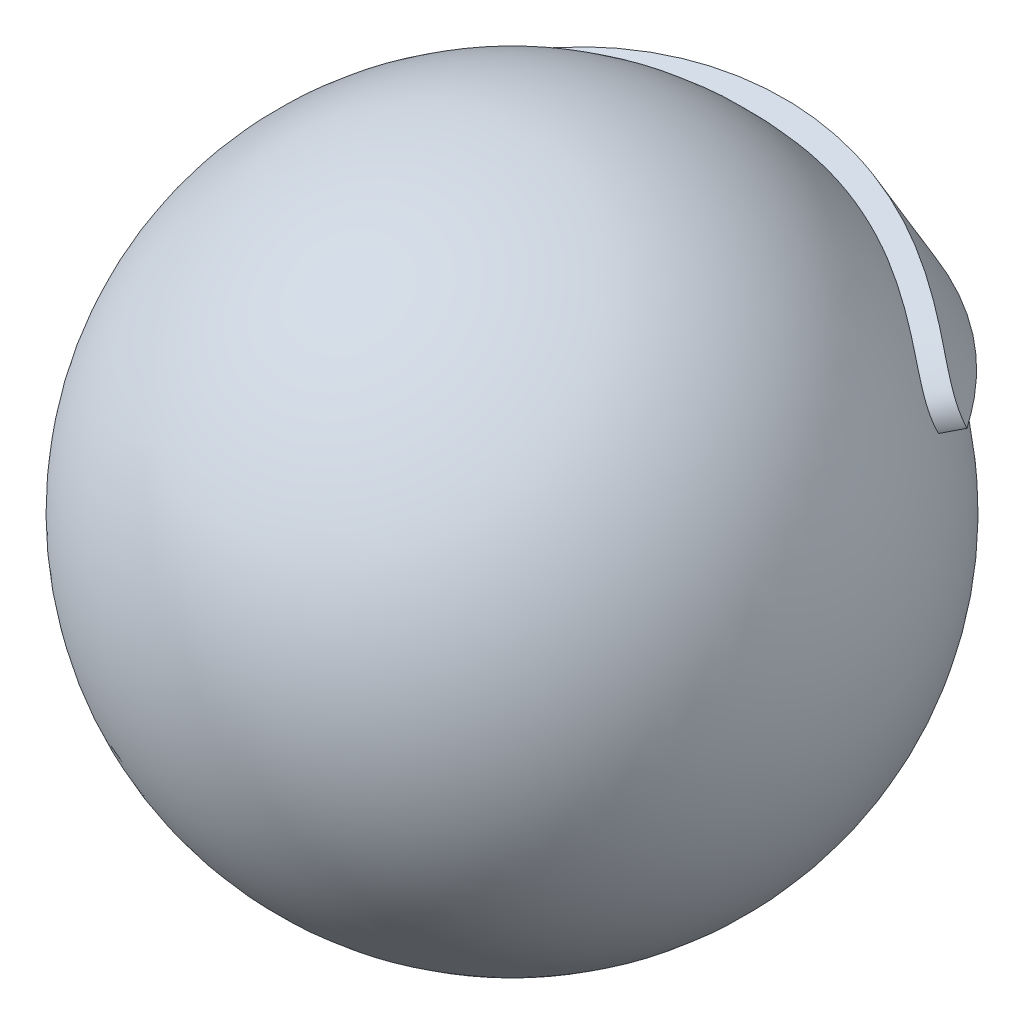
ISO-10303-21;
HEADER;
FILE_DESCRIPTION(('STEP AP214'),'2;1');
FILE_NAME('part.step','',(''),(''),'','','');
FILE_SCHEMA(('AUTOMOTIVE_DESIGN { 1 0 10303 214 1 1 1 1 }'));
ENDSEC;
DATA;
#1=APPLICATION_CONTEXT('core data for automotive mechanical design processes');
#2=APPLICATION_PROTOCOL_DEFINITION('international standard','automotive_design',2000,#1);
#3=PRODUCT_CONTEXT('',#1,'mechanical');
#4=PRODUCT('Part','Part','',(#3));
#5=PRODUCT_RELATED_PRODUCT_CATEGORY('part','',(#4));
#6=PRODUCT_DEFINITION_FORMATION('','',#4);
#7=PRODUCT_DEFINITION_CONTEXT('part definition',#1,'design');
#8=PRODUCT_DEFINITION('design','',#6,#7);
#9=PRODUCT_DEFINITION_SHAPE('','',#8);
#10=(LENGTH_UNIT() NAMED_UNIT(*) SI_UNIT(.MILLI.,.METRE.));
#11=(NAMED_UNIT(*) PLANE_ANGLE_UNIT() SI_UNIT($,.RADIAN.));
#12=(NAMED_UNIT(*) SI_UNIT($,.STERADIAN.) SOLID_ANGLE_UNIT());
#13=UNCERTAINTY_MEASURE_WITH_UNIT(LENGTH_MEASURE(1.E-05),#10,'distance_accuracy_value','');
#14=(GEOMETRIC_REPRESENTATION_CONTEXT(3) GLOBAL_UNCERTAINTY_ASSIGNED_CONTEXT((#13)) GLOBAL_UNIT_ASSIGNED_CONTEXT((#10,
#11,#12)) REPRESENTATION_CONTEXT('',''));
#15=CARTESIAN_POINT('',(0.,0.,0.));
#16=DIRECTION('',(0.,0.,1.));
#17=DIRECTION('',(1.,0.,0.));
#18=AXIS2_PLACEMENT_3D('',#15,#16,#17);
#19=CARTESIAN_POINT('',(0.,0.,0.));
#20=DIRECTION('',(0.,1.,0.));
#21=DIRECTION('',(1.,0.,0.));
#22=AXIS2_PLACEMENT_3D('',#19,#20,#21);
#23=SPHERICAL_SURFACE('',#22,15.);
#24=CARTESIAN_POINT('',(11.8503791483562,5.23710315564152,-7.55918412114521));
#25=CARTESIAN_POINT('',(11.8234220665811,5.23710315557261,-7.60144415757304));
#26=CARTESIAN_POINT('',(11.7962377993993,5.2371031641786,-7.64355926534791));
#27=CARTESIAN_POINT('',(11.7412553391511,5.23710319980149,-7.72774545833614));
#28=CARTESIAN_POINT('',(11.7134544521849,5.23710322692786,-7.76981478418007));
#29=CARTESIAN_POINT('',(11.6572362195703,5.23710330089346,-7.85389724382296));
#30=CARTESIAN_POINT('',(11.6288162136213,5.23710334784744,-7.8959085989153));
#31=CARTESIAN_POINT('',(11.5713571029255,5.23710346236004,-7.97986307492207));
#32=CARTESIAN_POINT('',(11.5423153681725,5.23710353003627,-8.02180439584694));
#33=CARTESIAN_POINT('',(11.4836101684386,5.23710368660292,-8.10560676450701));
#34=CARTESIAN_POINT('',(11.4539441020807,5.23710377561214,-8.14746598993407));
#35=CARTESIAN_POINT('',(11.3939876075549,5.23710397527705,-8.23109212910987));
#36=CARTESIAN_POINT('',(11.3636946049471,5.23710408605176,-8.27285719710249));
#37=CARTESIAN_POINT('',(11.302481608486,5.23710432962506,-8.35628298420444));
#38=CARTESIAN_POINT('',(11.2715590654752,5.23710446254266,-8.39794183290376));
#39=CARTESIAN_POINT('',(11.2090843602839,5.23710475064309,-8.48114314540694));
#40=CARTESIAN_POINT('',(11.1775296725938,5.23710490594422,-8.52268371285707));
#41=CARTESIAN_POINT('',(11.1137880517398,5.23710523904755,-8.60563642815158));
#42=CARTESIAN_POINT('',(11.0815986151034,5.23710541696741,-8.64704665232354));
#43=CARTESIAN_POINT('',(11.0165848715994,5.23710579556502,-8.72972664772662));
#44=CARTESIAN_POINT('',(10.9837580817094,5.23710599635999,-8.77099446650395));
#45=CARTESIAN_POINT('',(10.9174670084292,5.23710642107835,-8.85337761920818));
#46=CARTESIAN_POINT('',(10.8840002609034,5.23710664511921,-8.89449097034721));
#47=CARTESIAN_POINT('',(10.8164266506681,5.23710711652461,-8.97655315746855));
#48=CARTESIAN_POINT('',(10.782317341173,5.23710736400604,-9.0174999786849));
#49=CARTESIAN_POINT('',(10.7134559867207,5.23710788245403,-9.09921707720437));
#50=CARTESIAN_POINT('',(10.6787015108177,5.23710815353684,-9.13998530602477));
#51=CARTESIAN_POINT('',(10.6085472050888,5.2371087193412,-9.2213331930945));
#52=CARTESIAN_POINT('',(10.5731449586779,5.23710901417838,-9.26191076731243));
#53=CARTESIAN_POINT('',(10.5016924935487,5.23710962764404,-9.34286531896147));
#54=CARTESIAN_POINT('',(10.4656398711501,5.23710994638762,-9.38324017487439));
#55=CARTESIAN_POINT('',(10.3928840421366,5.23711060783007,-9.46377727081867));
#56=CARTESIAN_POINT('',(10.3561784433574,5.2371109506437,-9.50393734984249));
#57=CARTESIAN_POINT('',(10.2821140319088,5.23711166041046,-9.58403285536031));
#58=CARTESIAN_POINT('',(10.244752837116,5.23711202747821,-9.62396607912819));
#59=CARTESIAN_POINT('',(10.1693746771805,5.23711278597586,-9.70359591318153));
#60=CARTESIAN_POINT('',(10.1313553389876,5.23711317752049,-9.7432902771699));
#61=CARTESIAN_POINT('',(10.0546580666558,5.23711398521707,-9.82243015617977));
#62=CARTESIAN_POINT('',(10.0159777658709,5.23711440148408,-9.86187337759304));
#63=CARTESIAN_POINT('',(9.93795677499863,5.23711525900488,-9.94049976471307));
#64=CARTESIAN_POINT('',(9.89861372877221,5.23711570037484,-9.97968059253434));
#65=CARTESIAN_POINT('',(9.81926239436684,5.23711660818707,-10.0577650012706));
#66=CARTESIAN_POINT('',(9.77925175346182,5.23711707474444,-10.0966661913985));
#67=CARTESIAN_POINT('',(9.69856813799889,5.23711803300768,-10.1741765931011));
#68=CARTESIAN_POINT('',(9.65789286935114,5.23711852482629,-10.2127834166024));
#69=CARTESIAN_POINT('',(9.57588384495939,5.2371195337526,-10.2896907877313));
#70=CARTESIAN_POINT('',(9.53454785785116,5.23712005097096,-10.3279889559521));
#71=CARTESIAN_POINT('',(9.45122106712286,5.23712111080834,-10.4042645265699));
#72=CARTESIAN_POINT('',(9.40922809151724,5.2371216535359,-10.4422395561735));
#73=CARTESIAN_POINT('',(9.32459104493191,5.23712276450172,-10.5178544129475));
#74=CARTESIAN_POINT('',(9.28194485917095,5.23712333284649,-10.5554918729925));
#75=CARTESIAN_POINT('',(9.19600510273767,5.23712449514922,-10.6304171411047));
#76=CARTESIAN_POINT('',(9.15270947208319,5.23712508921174,-10.6677025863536));
#77=CARTESIAN_POINT('',(9.0654745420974,5.23712630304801,-10.7419093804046));
#78=CARTESIAN_POINT('',(9.02153323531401,5.23712692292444,-10.7788283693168));
#79=CARTESIAN_POINT('',(8.93301067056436,5.2371281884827,-10.8522878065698));
#80=CARTESIAN_POINT('',(8.8884274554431,5.23712883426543,-10.8888258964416));
#81=CARTESIAN_POINT('',(8.79862479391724,5.23713015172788,-10.9615090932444));
#82=CARTESIAN_POINT('',(8.75340343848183,5.23713082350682,-10.9976518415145));
#83=CARTESIAN_POINT('',(8.66232821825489,5.23713219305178,-11.0695299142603));
#84=CARTESIAN_POINT('',(8.61647249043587,5.23713289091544,-11.1052628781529));
#85=CARTESIAN_POINT('',(8.52413224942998,5.23713431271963,-11.1763069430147));
#86=CARTESIAN_POINT('',(8.47764591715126,5.23713503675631,-11.2116156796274));
#87=CARTESIAN_POINT('',(8.38404819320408,5.23713651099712,-11.2817968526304));
#88=CARTESIAN_POINT('',(8.33693502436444,5.23713726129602,-11.3166669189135));
#89=CARTESIAN_POINT('',(8.24208735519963,5.23713878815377,-11.3859563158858));
#90=CARTESIAN_POINT('',(8.19435111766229,5.23713956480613,-11.4203732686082));
#91=CARTESIAN_POINT('',(8.09826104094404,5.23714114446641,-11.4887420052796));
#92=CARTESIAN_POINT('',(8.0499055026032,5.23714194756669,-11.5226914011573));
#93=CARTESIAN_POINT('',(7.95258055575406,5.23714358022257,-11.5901105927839));
#94=CARTESIAN_POINT('',(7.90360948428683,5.23714440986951,-11.6235779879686));
#95=CARTESIAN_POINT('',(7.80505720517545,5.23714609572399,-11.6900187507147));
#96=CARTESIAN_POINT('',(7.75547436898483,5.23714695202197,-11.7229897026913));
#97=CARTESIAN_POINT('',(7.65570229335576,5.23714869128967,-11.7884231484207));
#98=CARTESIAN_POINT('',(7.60551145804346,5.23714957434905,-11.8208832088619));
#99=CARTESIAN_POINT('',(7.50452712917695,5.23715136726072,-11.8852804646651));
#100=CARTESIAN_POINT('',(7.45373207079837,5.23715227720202,-11.9172152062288));
#101=CARTESIAN_POINT('',(7.35154300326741,5.23715412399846,-11.9805473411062));
#102=CARTESIAN_POINT('',(7.30014745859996,5.23715506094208,-12.0119422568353));
#103=CARTESIAN_POINT('',(7.19676172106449,5.23715696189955,-12.07418028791));
#104=CARTESIAN_POINT('',(7.14477002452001,5.2371579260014,-12.1050209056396));
#105=CARTESIAN_POINT('',(7.04019815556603,5.23715988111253,-12.1661290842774));
#106=CARTESIAN_POINT('',(6.98761653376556,5.23716087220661,-12.1963941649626));
#107=CARTESIAN_POINT('',(6.88187752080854,5.23716288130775,-12.256339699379));
#108=CARTESIAN_POINT('',(6.82871875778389,5.23716389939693,-12.2860177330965));
#109=CARTESIAN_POINT('',(6.72183705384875,5.23716596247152,-12.3447764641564));
#110=CARTESIAN_POINT('',(6.66811281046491,5.2371670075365,-12.3738547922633));
#111=CARTESIAN_POINT('',(6.56011196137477,5.23716912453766,-12.4314017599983));
#112=CARTESIAN_POINT('',(6.50583412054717,5.23717019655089,-12.4598680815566));
#113=CARTESIAN_POINT('',(6.39673783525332,5.23717236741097,-12.5161785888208));
#114=CARTESIAN_POINT('',(6.3419182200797,5.23717346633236,-12.5440205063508));
#115=CARTESIAN_POINT('',(6.23175016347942,5.23717569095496,-12.5990697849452));
#116=CARTESIAN_POINT('',(6.17640061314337,5.23717681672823,-12.6262749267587));
#117=CARTESIAN_POINT('',(6.0651844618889,5.23717909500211,-12.6800382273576));
#118=CARTESIAN_POINT('',(6.00931681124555,5.2371802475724,-12.7065942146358));
#119=CARTESIAN_POINT('',(5.89707623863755,5.23718257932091,-12.7590467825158));
#120=CARTESIAN_POINT('',(5.84070232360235,5.23718375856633,-12.7849412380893));
#121=CARTESIAN_POINT('',(5.72746100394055,5.23718614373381,-12.8360583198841));
#122=CARTESIAN_POINT('',(5.67059266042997,5.23718734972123,-12.8612788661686));
#123=CARTESIAN_POINT('',(5.5563742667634,5.23718978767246,-12.9110357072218));
#124=CARTESIAN_POINT('',(5.49902332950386,5.23719101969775,-12.9355699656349));
#125=CARTESIAN_POINT('',(5.3838515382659,5.23719351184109,-12.9839418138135));
#126=CARTESIAN_POINT('',(5.32602984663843,5.23719477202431,-13.0077774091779));
#127=CARTESIAN_POINT('',(5.20992832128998,5.23719731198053,-13.0547395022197));
#128=CARTESIAN_POINT('',(5.15164769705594,5.23719859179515,-13.0778640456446));
#129=CARTESIAN_POINT('',(5.03464014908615,5.23720120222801,-13.1233916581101));
#130=CARTESIAN_POINT('',(4.97591247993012,5.23720253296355,-13.1457928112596));
#131=CARTESIAN_POINT('',(4.85802244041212,5.23720512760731,-13.1898610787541));
#132=CARTESIAN_POINT('',(4.79885936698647,5.23720639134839,-13.211526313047));
#133=CARTESIAN_POINT('',(4.69994021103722,5.23720880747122,-13.2469999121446));
#134=CARTESIAN_POINT('',(4.66026298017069,5.23720985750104,-13.2610284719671));
#135=CARTESIAN_POINT('',(4.60255755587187,5.23721087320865,-13.2811393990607));
#136=CARTESIAN_POINT('',(4.58457888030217,5.23721111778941,-13.287364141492));
#137=CARTESIAN_POINT('',(4.51254200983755,5.23721120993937,-13.3121400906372));
#138=CARTESIAN_POINT('',(4.45838162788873,5.23720927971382,-13.3303953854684));
#139=CARTESIAN_POINT('',(4.34973375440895,5.2372008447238,-13.366269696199));
#140=CARTESIAN_POINT('',(4.2952458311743,5.23719433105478,-13.383887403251));
#141=CARTESIAN_POINT('',(4.18595340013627,5.23718008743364,-13.4184831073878));
#142=CARTESIAN_POINT('',(4.13114848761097,5.23717235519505,-13.435459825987));
#143=CARTESIAN_POINT('',(4.00898558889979,5.23713940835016,-13.4724484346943));
#144=CARTESIAN_POINT('',(3.94157441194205,5.23711065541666,-13.4922850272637));
#145=CARTESIAN_POINT('',(3.85833152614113,5.23710389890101,-13.5161477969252));
#146=CARTESIAN_POINT('',(3.84262712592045,5.23710388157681,-13.5206220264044));
#147=CARTESIAN_POINT('',(3.81905765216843,5.23710353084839,-13.5272914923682));
#148=CARTESIAN_POINT('',(3.81119855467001,5.2371033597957,-13.5295077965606));
#149=CARTESIAN_POINT('',(3.79940680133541,5.23710322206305,-13.5328221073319));
#150=CARTESIAN_POINT('',(3.79547557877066,5.23710319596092,-13.5339252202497));
#151=CARTESIAN_POINT('',(3.78957795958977,5.23710316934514,-13.5355773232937));
#152=CARTESIAN_POINT('',(3.78761192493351,5.23710316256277,-13.5361276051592));
#153=CARTESIAN_POINT('',(3.78466267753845,5.23710315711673,-13.536952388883));
#154=CARTESIAN_POINT('',(3.78367955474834,5.23710315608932,-13.5372272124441));
#155=CARTESIAN_POINT('',(3.78257350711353,5.23710315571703,-13.5375362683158));
#156=CARTESIAN_POINT('',(3.78245061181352,5.23710315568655,-13.5375706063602));
#157=CARTESIAN_POINT('',(3.78220482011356,5.23710315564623,-13.5376392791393));
#158=CARTESIAN_POINT('',(3.78208192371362,5.23710315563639,-13.5376736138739));
#159=CARTESIAN_POINT('',(3.78171323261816,5.23710315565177,-13.5377766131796));
#160=CARTESIAN_POINT('',(3.7814674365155,5.23710315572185,-13.537845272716));
#161=CARTESIAN_POINT('',(3.78073004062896,5.23710315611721,-13.5380512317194));
#162=CARTESIAN_POINT('',(3.78023843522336,5.2371031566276,-13.5381885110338));
#163=CARTESIAN_POINT('',(3.74827796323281,5.23710320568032,-13.5471114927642));
#164=CARTESIAN_POINT('',(3.71677826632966,5.23710425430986,-13.555787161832));
#165=CARTESIAN_POINT('',(3.65089169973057,5.23710824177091,-13.5736861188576));
#166=CARTESIAN_POINT('',(3.61649922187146,5.23711134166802,-13.5828887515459));
#167=CARTESIAN_POINT('',(3.55327286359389,5.23711850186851,-13.5995488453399));
#168=CARTESIAN_POINT('',(3.52444935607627,5.23712232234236,-13.6070456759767));
#169=CARTESIAN_POINT('',(3.47291388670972,5.2371300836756,-13.6202748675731));
#170=CARTESIAN_POINT('',(3.45021089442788,5.23713382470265,-13.626042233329));
#171=CARTESIAN_POINT('',(3.37338031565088,5.23714725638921,-13.6453551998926));
#172=CARTESIAN_POINT('',(3.31918555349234,5.23715802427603,-13.6586349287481));
#173=CARTESIAN_POINT('',(3.21465443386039,5.23718028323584,-13.6835894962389));
#174=CARTESIAN_POINT('',(3.16432903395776,5.23719166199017,-13.6953104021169));
#175=CARTESIAN_POINT('',(3.0237837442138,5.23722358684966,-13.7272264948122));
#176=CARTESIAN_POINT('',(2.93342374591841,5.23724428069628,-13.7468093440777));
#177=CARTESIAN_POINT('',(2.78070045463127,5.23727764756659,-13.7783348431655));
#178=CARTESIAN_POINT('',(2.71843389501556,5.23729080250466,-13.7907491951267));
#179=CARTESIAN_POINT('',(2.60453259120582,5.23731381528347,-13.81265910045));
#180=CARTESIAN_POINT('',(2.55292348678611,5.23732384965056,-13.822287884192));
#181=CARTESIAN_POINT('',(2.46045470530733,5.23734060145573,-13.8390057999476));
#182=CARTESIAN_POINT('',(2.41961464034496,5.23734757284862,-13.8462034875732));
#183=CARTESIAN_POINT('',(2.36754050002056,5.23735507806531,-13.8551430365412));
#184=CARTESIAN_POINT('',(2.35633508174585,5.23735661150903,-13.8570526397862));
#185=CARTESIAN_POINT('',(2.30757685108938,5.23736303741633,-13.865301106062));
#186=CARTESIAN_POINT('',(2.27000044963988,5.23736735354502,-13.8715010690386));
#187=CARTESIAN_POINT('',(2.17595435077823,5.23737716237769,-13.8866275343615));
#188=CARTESIAN_POINT('',(2.11945389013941,5.23738216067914,-13.8953632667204));
#189=CARTESIAN_POINT('',(2.00630205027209,5.23739014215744,-13.9121547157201));
#190=CARTESIAN_POINT('',(1.94965058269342,5.23739312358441,-13.9202098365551));
#191=CARTESIAN_POINT('',(1.83620904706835,5.23739713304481,-13.9356367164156));
#192=CARTESIAN_POINT('',(1.77941890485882,5.23739815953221,-13.9430079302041));
#193=CARTESIAN_POINT('',(1.66571243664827,5.23739823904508,-13.9570634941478));
#194=CARTESIAN_POINT('',(1.60879604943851,5.23739729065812,-13.9637473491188));
#195=CARTESIAN_POINT('',(1.49484948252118,5.23739342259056,-13.9764247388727));
#196=CARTESIAN_POINT('',(1.43781925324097,5.2373905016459,-13.9824178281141));
#197=CARTESIAN_POINT('',(1.32365740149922,5.23738268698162,-13.9937102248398));
#198=CARTESIAN_POINT('',(1.2665257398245,5.23737779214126,-13.9990091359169));
#199=CARTESIAN_POINT('',(1.15217342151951,5.23736602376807,-14.0089097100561));
#200=CARTESIAN_POINT('',(1.09495273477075,5.23735914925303,-14.0135110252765));
#201=CARTESIAN_POINT('',(0.98043476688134,5.23734344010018,-14.0220129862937));
#202=CARTESIAN_POINT('',(0.923137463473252,5.23733460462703,-14.0259133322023));
#203=CARTESIAN_POINT('',(0.808478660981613,5.23731490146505,-14.0330097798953));
#204=CARTESIAN_POINT('',(0.751117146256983,5.23730403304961,-14.0362056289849));
#205=CARTESIAN_POINT('',(0.636342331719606,5.23728053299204,-14.0418900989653));
#206=CARTESIAN_POINT('',(0.578929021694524,5.2372679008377,-14.0443785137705));
#207=CARTESIAN_POINT('',(0.464062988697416,5.23723987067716,-14.0486429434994));
#208=CARTESIAN_POINT('',(0.406610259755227,5.23722447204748,-14.0504187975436));
#209=CARTESIAN_POINT('',(0.291677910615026,5.23719465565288,-14.0532611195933));
#210=CARTESIAN_POINT('',(0.2341982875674,5.23718023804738,-14.0543274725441));
#211=CARTESIAN_POINT('',(0.119224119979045,5.23713840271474,-14.0557232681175));
#212=CARTESIAN_POINT('',(0.0617295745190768,5.23711098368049,-14.0560526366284));
#213=CARTESIAN_POINT('',(0.00422381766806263,5.23710315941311,-14.0560567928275));
#214=CARTESIAN_POINT('',(0.00421186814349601,5.23710315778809,-14.0560567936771));
#215=CARTESIAN_POINT('',(0.00418796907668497,5.23710315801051,-14.0560568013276));
#216=CARTESIAN_POINT('',(0.00417601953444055,5.23710315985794,-14.0560568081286));
#217=CARTESIAN_POINT('',(0.00414017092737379,5.23710316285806,-14.0560568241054));
#218=CARTESIAN_POINT('',(0.00411627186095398,5.23710316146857,-14.0560568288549));
#219=CARTESIAN_POINT('',(0.00404457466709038,5.23710315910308,-14.0560568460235));
#220=CARTESIAN_POINT('',(0.0039967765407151,5.23710315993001,-14.0560568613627));
#221=CARTESIAN_POINT('',(0.00385338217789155,5.2371031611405,-14.0560569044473));
#222=CARTESIAN_POINT('',(0.00375778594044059,5.23710316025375,-14.05605692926));
#223=CARTESIAN_POINT('',(0.00347099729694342,5.23710315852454,-14.0560570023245));
#224=CARTESIAN_POINT('',(0.00327980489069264,5.23710315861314,-14.0560570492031));
#225=CARTESIAN_POINT('',(0.00270622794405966,5.2371031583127,-14.0560571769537));
#226=CARTESIAN_POINT('',(0.00232384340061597,5.23710315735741,-14.0560572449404));
#227=CARTESIAN_POINT('',(0.00155907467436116,5.23710315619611,-14.0560573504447));
#228=CARTESIAN_POINT('',(0.00117669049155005,5.23710315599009,-14.0560573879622));
#229=CARTESIAN_POINT('',(0.000603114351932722,5.23710315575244,-14.0560574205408));
#230=CARTESIAN_POINT('',(0.000411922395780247,5.23710315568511,-14.0560574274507));
#231=CARTESIAN_POINT('',(2.95385735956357E-05,5.2371031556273,-14.0560574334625));
#232=CARTESIAN_POINT('',(-0.0001616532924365,5.23710315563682,-14.0560574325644));
#233=CARTESIAN_POINT('',(-0.00188237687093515,5.23710315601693,-14.0560573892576));
#234=CARTESIAN_POINT('',(-0.00341190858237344,5.23710315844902,-14.0560571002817));
#235=CARTESIAN_POINT('',(-0.00800048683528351,5.23710317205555,-14.0560554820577));
#236=CARTESIAN_POINT('',(-0.0110595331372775,5.23710318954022,-14.0560534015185));
#237=CARTESIAN_POINT('',(-0.0202366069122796,5.23710326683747,-14.0560441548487));
#238=CARTESIAN_POINT('',(-0.0263546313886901,5.23710335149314,-14.0560339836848));
#239=CARTESIAN_POINT('',(-0.0447084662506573,5.23710370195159,-14.0559914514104));
#240=CARTESIAN_POINT('',(-0.0569442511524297,5.23710406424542,-14.0559470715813));
#241=CARTESIAN_POINT('',(-0.0936507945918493,5.23710551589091,-14.0557658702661));
#242=CARTESIAN_POINT('',(-0.118121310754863,5.2371069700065,-14.0555809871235));
#243=CARTESIAN_POINT('',(-0.191531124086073,5.23711260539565,-14.0548341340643));
#244=CARTESIAN_POINT('',(-0.240468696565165,5.23711805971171,-14.0540799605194));
#245=CARTESIAN_POINT('',(-0.304110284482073,5.23712685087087,-14.0527661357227));
#246=CARTESIAN_POINT('',(-0.318819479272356,5.23712900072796,-14.0524393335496));
#247=CARTESIAN_POINT('',(-0.390216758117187,5.23713992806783,-14.0507406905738));
#248=CARTESIAN_POINT('',(-0.446897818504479,5.23715010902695,-14.0490482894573));
#249=CARTESIAN_POINT('',(-0.530035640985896,5.23716646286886,-14.046061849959));
#250=CARTESIAN_POINT('',(-0.556502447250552,5.23717188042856,-14.0450361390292));
#251=CARTESIAN_POINT('',(-0.616423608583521,5.23718435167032,-14.0425439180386));
#252=CARTESIAN_POINT('',(-0.649876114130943,5.23719145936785,-14.0410325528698));
#253=CARTESIAN_POINT('',(-0.740645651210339,5.2372108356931,-14.0366059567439));
#254=CARTESIAN_POINT('',(-0.797951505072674,5.23722316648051,-14.0334587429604));
#255=CARTESIAN_POINT('',(-0.912499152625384,5.23724798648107,-14.0264646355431));
#256=CARTESIAN_POINT('',(-0.969740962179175,5.23726047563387,-14.0226180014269));
#257=CARTESIAN_POINT('',(-1.07461828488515,5.23728404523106,-14.0149281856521));
#258=CARTESIAN_POINT('',(-1.12226166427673,5.23729501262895,-14.0111917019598));
#259=CARTESIAN_POINT('',(-1.2351378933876,5.23731959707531,-14.001760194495));
#260=CARTESIAN_POINT('',(-1.30035309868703,5.23733269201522,-13.995852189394));
#261=CARTESIAN_POINT('',(-1.42187237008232,5.23735282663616,-13.9839851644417));
#262=CARTESIAN_POINT('',(-1.47818773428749,5.23736044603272,-13.9781413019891));
#263=CARTESIAN_POINT('',(-1.59118896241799,5.23737289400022,-13.9657251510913));
#264=CARTESIAN_POINT('',(-1.64787423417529,5.23737770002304,-13.9591474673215));
#265=CARTESIAN_POINT('',(-1.76159991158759,5.2373843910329,-13.9452495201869));
#266=CARTESIAN_POINT('',(-1.8186396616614,5.23738625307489,-13.9379238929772));
#267=CARTESIAN_POINT('',(-1.93305839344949,5.23738707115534,-13.9225161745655));
#268=CARTESIAN_POINT('',(-1.99043665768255,5.23738600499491,-13.9144287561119));
#269=CARTESIAN_POINT('',(-2.10551598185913,5.23738105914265,-13.8974837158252));
#270=CARTESIAN_POINT('',(-2.16321626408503,5.23737715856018,-13.8886208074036));
#271=CARTESIAN_POINT('',(-2.25952140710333,5.23736802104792,-13.8732140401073));
#272=CARTESIAN_POINT('',(-2.29815792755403,5.23736364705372,-13.866867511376));
#273=CARTESIAN_POINT('',(-2.3666759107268,5.2373553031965,-13.8553196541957));
#274=CARTESIAN_POINT('',(-2.39656823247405,5.23735146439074,-13.8501825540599));
#275=CARTESIAN_POINT('',(-2.51271428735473,5.23733678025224,-13.8298384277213));
#276=CARTESIAN_POINT('',(-2.59884604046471,5.23732638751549,-13.8139274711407));
#277=CARTESIAN_POINT('',(-2.7657894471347,5.23730663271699,-13.7814803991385));
#278=CARTESIAN_POINT('',(-2.84661872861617,5.23729724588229,-13.7650346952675));
#279=CARTESIAN_POINT('',(-3.00299814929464,5.23727969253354,-13.7317845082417));
#280=CARTESIAN_POINT('',(-3.07856630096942,5.23727148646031,-13.7150647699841));
#281=CARTESIAN_POINT('',(-3.22447109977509,5.23725625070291,-13.6815141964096));
#282=CARTESIAN_POINT('',(-3.29482595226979,5.2372491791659,-13.6647624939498));
#283=CARTESIAN_POINT('',(-3.4303582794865,5.23723622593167,-13.6313777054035));
#284=CARTESIAN_POINT('',(-3.49555387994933,5.23723029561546,-13.614818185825));
#285=CARTESIAN_POINT('',(-3.62082611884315,5.23721962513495,-13.5820299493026));
#286=CARTESIAN_POINT('',(-3.68092057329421,5.23721482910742,-13.5658692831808));
#287=CARTESIAN_POINT('',(-3.79605018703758,5.23720643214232,-13.5340742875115));
#288=CARTESIAN_POINT('',(-3.8511026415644,5.23720276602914,-13.5185025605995));
#289=CARTESIAN_POINT('',(-3.95621108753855,5.23719663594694,-13.4880722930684));
#290=CARTESIAN_POINT('',(-4.00628345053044,5.23719409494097,-13.4732702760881));
#291=CARTESIAN_POINT('',(-4.10149670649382,5.23719022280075,-13.4445430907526));
#292=CARTESIAN_POINT('',(-4.14665293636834,5.23718879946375,-13.4306687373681));
#293=CARTESIAN_POINT('',(-4.23209600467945,5.23718718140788,-13.4039432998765));
#294=CARTESIAN_POINT('',(-4.27239699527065,5.23718687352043,-13.3911374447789));
#295=CARTESIAN_POINT('',(-4.34818757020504,5.23718749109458,-13.3666782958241));
#296=CARTESIAN_POINT('',(-4.38369000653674,5.23718827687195,-13.3550648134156));
#297=CARTESIAN_POINT('',(-4.44993672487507,5.23719116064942,-13.3331036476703));
#298=CARTESIAN_POINT('',(-4.48069244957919,5.23719307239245,-13.3227904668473));
#299=CARTESIAN_POINT('',(-4.53749353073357,5.23719810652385,-13.3035272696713));
#300=CARTESIAN_POINT('',(-4.5635488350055,5.23720100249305,-13.2946065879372));
#301=CARTESIAN_POINT('',(-4.59722835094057,5.2372063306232,-13.2829678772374));
#302=CARTESIAN_POINT('',(-4.60487610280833,5.23720764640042,-13.2803178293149));
#303=CARTESIAN_POINT('',(-4.64945038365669,5.23721537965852,-13.2648292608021));
#304=CARTESIAN_POINT('',(-4.68632595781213,5.23722203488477,-13.2518437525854));
#305=CARTESIAN_POINT('',(-4.77827868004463,5.23723763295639,-13.2190303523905));
#306=CARTESIAN_POINT('',(-4.83328767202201,5.23724606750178,-13.1990112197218));
#307=CARTESIAN_POINT('',(-4.94293070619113,5.23726174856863,-13.1583329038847));
#308=CARTESIAN_POINT('',(-4.99756530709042,5.23726899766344,-13.1376752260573));
#309=CARTESIAN_POINT('',(-5.10644995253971,5.23728213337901,-13.0957294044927));
#310=CARTESIAN_POINT('',(-5.16070058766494,5.23728802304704,-13.0744427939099));
#311=CARTESIAN_POINT('',(-5.26880770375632,5.23729849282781,-13.0312491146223));
#312=CARTESIAN_POINT('',(-5.32266480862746,5.23730307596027,-13.0093436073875));
#313=CARTESIAN_POINT('',(-5.42997526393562,5.23731092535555,-12.9649220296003));
#314=CARTESIAN_POINT('',(-5.48342927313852,5.23731419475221,-12.9424075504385));
#315=CARTESIAN_POINT('',(-5.58992393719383,5.23731942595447,-12.8967779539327));
#316=CARTESIAN_POINT('',(-5.64296528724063,5.23732139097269,-12.8736644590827));
#317=CARTESIAN_POINT('',(-5.74862503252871,5.23732401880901,-12.8268467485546));
#318=CARTESIAN_POINT('',(-5.80124416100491,5.23732468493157,-12.8031441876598));
#319=CARTESIAN_POINT('',(-5.90604986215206,5.23732472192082,-12.7551582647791));
#320=CARTESIAN_POINT('',(-5.95823720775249,5.23732409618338,-12.7308765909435));
#321=CARTESIAN_POINT('',(-6.06216974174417,5.23732155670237,-12.6817423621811));
#322=CARTESIAN_POINT('',(-6.1139157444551,5.23731964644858,-12.6568915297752));
#323=CARTESIAN_POINT('',(-6.2169559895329,5.23731454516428,-12.6066289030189));
#324=CARTESIAN_POINT('',(-6.26825108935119,5.23731135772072,-12.5812188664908));
#325=CARTESIAN_POINT('',(-6.37037992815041,5.23730371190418,-12.5298477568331));
#326=CARTESIAN_POINT('',(-6.42121456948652,5.23729925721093,-12.5038884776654));
#327=CARTESIAN_POINT('',(-6.52241287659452,5.23728907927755,-12.4514287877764));
#328=CARTESIAN_POINT('',(-6.57277749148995,5.23728335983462,-12.4249302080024));
#329=CARTESIAN_POINT('',(-6.67302617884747,5.23727068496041,-12.3714019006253));
#330=CARTESIAN_POINT('',(-6.72291124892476,5.23726373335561,-12.3443740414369));
#331=CARTESIAN_POINT('',(-6.82219109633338,5.23724851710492,-12.2897968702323));
#332=CARTESIAN_POINT('',(-6.87158692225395,5.23724025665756,-12.2622494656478));
#333=CARTESIAN_POINT('',(-6.9698792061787,5.23722275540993,-12.2066439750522));
#334=CARTESIAN_POINT('',(-7.01877676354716,5.23721351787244,-12.1785878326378));
#335=CARTESIAN_POINT('',(-7.11606081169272,5.23719287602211,-12.1219717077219));
#336=CARTESIAN_POINT('',(-7.16444846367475,5.23718147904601,-12.0934137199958));
#337=CARTESIAN_POINT('',(-7.26071082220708,5.23716097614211,-12.0358172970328));
#338=CARTESIAN_POINT('',(-7.30858672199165,5.23715186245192,-12.006780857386));
#339=CARTESIAN_POINT('',(-7.38270338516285,5.23712661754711,-11.9611941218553));
#340=CARTESIAN_POINT('',(-7.40907124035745,5.23711542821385,-11.9448501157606));
#341=CARTESIAN_POINT('',(-7.44090374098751,5.23711405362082,-11.9249984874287));
#342=CARTESIAN_POINT('',(-7.44641126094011,5.23711425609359,-11.9215594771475));
#343=CARTESIAN_POINT('',(-7.49297326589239,5.23711643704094,-11.8924411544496));
#344=CARTESIAN_POINT('',(-7.5339000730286,5.23712144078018,-11.8665571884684));
#345=CARTESIAN_POINT('',(-7.63858207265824,5.23713365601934,-11.7995881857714));
#346=CARTESIAN_POINT('',(-7.70214050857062,5.23714051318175,-11.7581953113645));
#347=CARTESIAN_POINT('',(-7.83613762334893,5.23715564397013,-11.669376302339));
#348=CARTESIAN_POINT('',(-7.90649043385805,5.23716398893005,-11.6218204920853));
#349=CARTESIAN_POINT('',(-8.01425274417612,5.23717638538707,-11.5475469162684));
#350=CARTESIAN_POINT('',(-8.05197130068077,5.23718065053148,-11.5212763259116));
#351=CARTESIAN_POINT('',(-8.13484767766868,5.23718929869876,-11.4629477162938));
#352=CARTESIAN_POINT('',(-8.17994691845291,5.23719352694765,-11.4308063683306));
#353=CARTESIAN_POINT('',(-8.27328486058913,5.23720132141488,-11.3634514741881));
#354=CARTESIAN_POINT('',(-8.3214923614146,5.23720480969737,-11.3281946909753));
#355=CARTESIAN_POINT('',(-8.41528222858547,5.23721033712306,-11.2586800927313));
#356=CARTESIAN_POINT('',(-8.46088463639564,5.23721243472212,-11.2244493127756));
#357=CARTESIAN_POINT('',(-8.54953895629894,5.23721524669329,-11.1570559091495));
#358=CARTESIAN_POINT('',(-8.59261009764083,5.23721602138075,-11.1239185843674));
#359=CARTESIAN_POINT('',(-8.66290940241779,5.23721603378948,-11.06918121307));
#360=CARTESIAN_POINT('',(-8.69025202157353,5.23721572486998,-11.0477280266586));
#361=CARTESIAN_POINT('',(-8.73355400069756,5.23721491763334,-11.0134933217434));
#362=CARTESIAN_POINT('',(-8.74956556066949,5.23721454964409,-11.0007777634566));
#363=CARTESIAN_POINT('',(-8.81335723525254,5.2372131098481,-10.9498915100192));
#364=CARTESIAN_POINT('',(-8.86091778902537,5.2372120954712,-10.9114448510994));
#365=CARTESIAN_POINT('',(-8.95531930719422,5.23720998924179,-10.8341136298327));
#366=CARTESIAN_POINT('',(-9.00216256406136,5.23720889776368,-10.7952318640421));
#367=CARTESIAN_POINT('',(-9.09512529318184,5.23720669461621,-10.7170474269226));
#368=CARTESIAN_POINT('',(-9.14124711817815,5.23720558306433,-10.6777475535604));
#369=CARTESIAN_POINT('',(-9.23276235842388,5.23720332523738,-10.5987440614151));
#370=CARTESIAN_POINT('',(-9.27815819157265,5.23720217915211,-10.5590432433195));
#371=CARTESIAN_POINT('',(-9.36821693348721,5.23719985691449,-10.4792549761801));
#372=CARTESIAN_POINT('',(-9.41288232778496,5.23719868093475,-10.4391703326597));
#373=CARTESIAN_POINT('',(-9.50147564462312,5.23719629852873,-10.3586315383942));
#374=CARTESIAN_POINT('',(-9.54540612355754,5.23719509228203,-10.3181801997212));
#375=CARTESIAN_POINT('',(-9.63252506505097,5.23719265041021,-10.2369251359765));
#376=CARTESIAN_POINT('',(-9.67571615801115,5.23719141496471,-10.1961242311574));
#377=CARTESIAN_POINT('',(-9.76135178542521,5.23718891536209,-10.1141871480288));
#378=CARTESIAN_POINT('',(-9.80379902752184,5.23718765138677,-10.0730537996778));
#379=CARTESIAN_POINT('',(-9.88794260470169,5.23718509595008,-9.99046874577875));
#380=CARTESIAN_POINT('',(-9.92964172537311,5.23718380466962,-9.94901987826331));
#381=CARTESIAN_POINT('',(-10.0122943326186,5.23718119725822,-9.86582451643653));
#382=CARTESIAN_POINT('',(-10.0532506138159,5.23717988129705,-9.82408079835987));
#383=CARTESIAN_POINT('',(-10.1344198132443,5.23717722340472,-9.74030934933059));
#384=CARTESIAN_POINT('',(-10.1746355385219,5.23717588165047,-9.69828433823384));
#385=CARTESIAN_POINT('',(-10.2543269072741,5.23717317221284,-9.61396487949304));
#386=CARTESIAN_POINT('',(-10.2938053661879,5.23717180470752,-9.57167309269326));
#387=CARTESIAN_POINT('',(-10.3720252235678,5.23716904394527,-9.48683438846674));
#388=CARTESIAN_POINT('',(-10.4107694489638,5.23716765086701,-9.44429007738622));
#389=CARTESIAN_POINT('',(-10.4875239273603,5.23716483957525,-9.35896069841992));
#390=CARTESIAN_POINT('',(-10.5255370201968,5.23716342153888,-9.31617818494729));
#391=CARTESIAN_POINT('',(-10.600832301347,5.23716056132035,-9.23038675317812));
#392=CARTESIAN_POINT('',(-10.6381173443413,5.23715911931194,-9.18738034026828));
#393=CARTESIAN_POINT('',(-10.7119595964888,5.23715621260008,-9.10115546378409));
#394=CARTESIAN_POINT('',(-10.7485196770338,5.23715474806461,-9.05793945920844));
#395=CARTESIAN_POINT('',(-10.8209150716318,5.23715179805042,-8.97130974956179));
#396=CARTESIAN_POINT('',(-10.8567532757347,5.23715031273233,-8.92789845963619));
#397=CARTESIAN_POINT('',(-10.9277079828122,5.23714732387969,-8.84089252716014));
#398=CARTESIAN_POINT('',(-10.9628273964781,5.237145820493,-8.79730025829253));
#399=CARTESIAN_POINT('',(-11.0323475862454,5.23714279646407,-8.70994671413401));
#400=CARTESIAN_POINT('',(-11.0667512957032,5.2371412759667,-8.66618777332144));
#401=CARTESIAN_POINT('',(-11.1348431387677,5.23713821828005,-8.57851522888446));
#402=CARTESIAN_POINT('',(-11.168534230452,5.237136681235,-8.53460392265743));
#403=CARTESIAN_POINT('',(-11.2352038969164,5.23713359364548,-8.44664098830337));
#404=CARTESIAN_POINT('',(-11.2681854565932,5.23713204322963,-8.40259162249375));
#405=CARTESIAN_POINT('',(-11.3334391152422,5.23712893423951,-8.31436690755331));
#406=CARTESIAN_POINT('',(-11.365714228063,5.2371273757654,-8.27019378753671));
#407=CARTESIAN_POINT('',(-11.4295580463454,5.23712425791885,-8.18173590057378));
#408=CARTESIAN_POINT('',(-11.4611297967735,5.23712269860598,-8.13745333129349));
#409=CARTESIAN_POINT('',(-11.5235699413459,5.2371195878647,-8.04879088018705));
#410=CARTESIAN_POINT('',(-11.5544414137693,5.23711803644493,-8.00441316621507));
#411=CARTESIAN_POINT('',(-11.6154840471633,5.23711495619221,-7.91557475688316));
#412=CARTESIAN_POINT('',(-11.6456583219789,5.23711342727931,-7.87111620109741));
#413=CARTESIAN_POINT('',(-11.705309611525,5.23711040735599,-7.78213044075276));
#414=CARTESIAN_POINT('',(-11.7347897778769,5.23710891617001,-7.73760534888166));
#415=CARTESIAN_POINT('',(-11.7930557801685,5.2371059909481,-7.64850096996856));
#416=CARTESIAN_POINT('',(-11.8218448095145,5.2371045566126,-7.60392377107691));
#417=CARTESIAN_POINT('',(-11.8503791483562,5.23710315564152,-7.5591841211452));
#418=B_SPLINE_CURVE_WITH_KNOTS('',3,(#24,#25,#26,#27,#28,#29,#30,#31,#32,#33,#34,#35,#36,#37,
#38,#39,#40,#41,#42,#43,#44,#45,#46,#47,#48,#49,#50,#51,#52,#53,#54,#55,#56,#57,#58,#59,#60,#61,
#62,#63,#64,#65,#66,#67,#68,#69,#70,#71,#72,#73,#74,#75,#76,#77,#78,#79,#80,#81,#82,#83,#84,#85,
#86,#87,#88,#89,#90,#91,#92,#93,#94,#95,#96,#97,#98,#99,#100,#101,#102,#103,#104,#105,#106,#107,
#108,#109,#110,#111,#112,#113,#114,#115,#116,#117,#118,#119,#120,#121,#122,#123,#124,#125,#126,
#127,#128,#129,#130,#131,#132,#133,#134,#135,#136,#137,#138,#139,#140,#141,#142,#143,#144,#145,
#146,#147,#148,#149,#150,#151,#152,#153,#154,#155,#156,#157,#158,#159,#160,#161,#162,#163,#164,
#165,#166,#167,#168,#169,#170,#171,#172,#173,#174,#175,#176,#177,#178,#179,#180,#181,#182,#183,
#184,#185,#186,#187,#188,#189,#190,#191,#192,#193,#194,#195,#196,#197,#198,#199,#200,#201,#202,
#203,#204,#205,#206,#207,#208,#209,#210,#211,#212,#213,#214,#215,#216,#217,#218,#219,#220,#221,
#222,#223,#224,#225,#226,#227,#228,#229,#230,#231,#232,#233,#234,#235,#236,#237,#238,#239,#240,
#241,#242,#243,#244,#245,#246,#247,#248,#249,#250,#251,#252,#253,#254,#255,#256,#257,#258,#259,
#260,#261,#262,#263,#264,#265,#266,#267,#268,#269,#270,#271,#272,#273,#274,#275,#276,#277,#278,
#279,#280,#281,#282,#283,#284,#285,#286,#287,#288,#289,#290,#291,#292,#293,#294,#295,#296,#297,
#298,#299,#300,#301,#302,#303,#304,#305,#306,#307,#308,#309,#310,#311,#312,#313,#314,#315,#316,
#317,#318,#319,#320,#321,#322,#323,#324,#325,#326,#327,#328,#329,#330,#331,#332,#333,#334,#335,
#336,#337,#338,#339,#340,#341,#342,#343,#344,#345,#346,#347,#348,#349,#350,#351,#352,#353,#354,
#355,#356,#357,#358,#359,#360,#361,#362,#363,#364,#365,#366,#367,#368,#369,#370,#371,#372,#373,
#374,#375,#376,#377,#378,#379,#380,#381,#382,#383,#384,#385,#386,#387,#388,#389,#390,#391,#392,
#393,#394,#395,#396,#397,#398,#399,#400,#401,#402,#403,#404,#405,#406,#407,#408,#409,#410,#411,
#412,#413,#414,#415,#416,#417),.UNSPECIFIED.,.F.,.F.,(4,2,2,2,2,2,2,2,2,2,2,2,2,2,2,2,2,2,2,2,2,
2,2,2,2,2,2,2,2,2,2,2,2,2,2,2,2,2,2,2,2,2,2,2,2,2,2,2,2,2,2,2,2,2,2,2,2,2,2,2,2,2,2,2,2,2,2,2,2,
2,2,2,2,2,2,2,2,2,2,2,2,2,2,2,2,2,2,2,2,2,2,2,2,2,2,2,2,2,2,2,2,2,2,2,2,2,2,2,2,2,2,2,2,2,2,2,2,
2,2,2,2,2,2,2,2,2,2,2,2,2,2,2,2,2,2,2,2,2,2,2,2,2,2,2,2,2,2,2,2,2,2,2,2,2,2,2,2,2,2,2,2,2,2,2,2,
2,2,2,2,2,2,2,2,2,2,2,2,2,2,2,2,2,2,2,2,2,2,2,2,2,2,2,2,2,2,2,4),(0.,0.150376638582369,
0.30164979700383,0.453810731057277,0.606851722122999,0.760765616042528,0.915545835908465,
1.07118639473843,1.22768190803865,1.38502760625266,1.54321934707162,1.70225362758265,
1.8621275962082,2.02283906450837,2.18438651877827,2.34676913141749,2.50998677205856,
2.6740400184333,2.83893016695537,3.00465924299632,3.17122995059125,3.33863973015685,
3.50687561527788,3.67592394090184,3.84577155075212,4.01640581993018,4.18781467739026,
4.35998662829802,4.53291077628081,4.70657684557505,4.8809752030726,5.05609688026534,
5.2319335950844,5.40847777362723,5.58572257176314,5.76366189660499,5.94229042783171,
6.12160363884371,6.30159781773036,6.48227008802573,6.66361686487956,6.84562048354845,
7.0282618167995,7.21152303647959,7.39538660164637,7.57983529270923,7.76485224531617,
7.95042098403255,8.13652545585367,8.32315006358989,8.51027969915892,8.69789977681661,
8.8859962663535,9.07455572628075,9.26356533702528,9.38981632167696,9.44689356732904,
9.6183512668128,9.79014299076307,9.96226098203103,10.1730592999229,10.2220472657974,
10.2465441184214,10.2587932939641,10.2649180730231,10.2679805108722,10.268363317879,
10.2687461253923,10.2695117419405,10.2710429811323,10.3690598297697,10.475866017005,
10.5652128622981,10.6354849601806,10.8028744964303,10.9578889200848,11.2352411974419,
11.4257121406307,11.5832077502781,11.7076144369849,11.7417153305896,11.8559673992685,
12.0274784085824,12.1991380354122,12.3709333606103,12.5428515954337,12.7148801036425,
12.8870064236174,13.0592182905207,13.231503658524,13.4038507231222,13.5762479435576,
13.7486840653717,13.9211481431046,14.093629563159,14.0936654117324,14.0937012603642,
14.0937729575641,14.0939163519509,14.0942031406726,14.0947767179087,14.0959238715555,
14.0970710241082,14.0976445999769,14.0982181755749,14.1028067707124,14.1119839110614,
14.1303380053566,14.1670455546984,14.240458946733,14.3872856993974,14.4314241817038,
14.6015378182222,14.6809975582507,14.7814566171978,14.9536287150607,15.1257370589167,
15.2691038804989,15.4655437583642,15.6353931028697,15.8065857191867,15.97910612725,
16.1529380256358,16.3280642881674,16.4455258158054,16.5365169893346,16.7992670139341,
17.0467108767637,17.2788873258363,17.4958436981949,17.6976339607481,17.8843168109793,
18.055949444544,18.2125892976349,18.3543057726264,18.4811639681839,18.5932237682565,
18.6905394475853,18.7731592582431,18.797440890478,18.9147249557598,19.0903356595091,
19.2655599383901,19.440387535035,19.614807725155,19.7888093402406,19.962380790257,
20.1355100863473,20.3081848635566,20.4803924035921,20.6521196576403,20.8233532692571,
20.9940795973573,21.164284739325,21.3339545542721,21.5030746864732,21.6716302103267,
21.8396046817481,21.9326713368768,21.9521504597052,22.0974228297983,22.3249593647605,
22.5796982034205,22.7175931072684,22.8837307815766,23.0628990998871,23.2339561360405,
23.3969825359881,23.5012443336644,23.5625834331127,23.7460479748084,23.9286758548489,
24.110454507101,24.2913706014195,24.4714100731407,24.6505581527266,24.8287993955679,
25.0061177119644,25.18249734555,25.357933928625,25.5324305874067,25.7059896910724,
25.8786126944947,26.0503001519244,26.2210517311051,26.3908662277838,26.5597415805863,
26.7276748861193,26.8946624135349,27.0606996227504,27.2257811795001,27.3899009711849,
27.5530521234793,27.715227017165,27.8764173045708,28.0366139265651,28.1958066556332),.UNSPECIFIED.);
#419=CARTESIAN_POINT('',(11.8503794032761,5.23710315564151,-7.55918372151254));
#420=VERTEX_POINT('',#419);
#421=CARTESIAN_POINT('',(-11.8503777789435,5.23710315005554,-7.5591862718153));
#422=VERTEX_POINT('',#421);
#423=EDGE_CURVE('E11',#420,#422,#418,.T.);
#424=ORIENTED_EDGE('',*,*,#423,.F.);
#425=CARTESIAN_POINT('',(-11.8503793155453,5.23710368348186,-7.55918349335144));
#426=CARTESIAN_POINT('',(-11.8465816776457,5.25995289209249,-7.54930676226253));
#427=CARTESIAN_POINT('',(-11.8424000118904,5.28291091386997,-7.53982898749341));
#428=CARTESIAN_POINT('',(-11.8333002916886,5.32887674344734,-7.52174149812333));
#429=CARTESIAN_POINT('',(-11.8283862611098,5.35188364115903,-7.51312744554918));
#430=CARTESIAN_POINT('',(-11.8178405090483,5.39790275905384,-7.49677496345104));
#431=CARTESIAN_POINT('',(-11.8122126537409,5.42091432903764,-7.48903221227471));
#432=CARTESIAN_POINT('',(-11.8002577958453,5.46689920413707,-7.47442949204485));
#433=CARTESIAN_POINT('',(-11.7939344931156,5.48987210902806,-7.4675652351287));
#434=CARTESIAN_POINT('',(-11.7806070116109,5.53573695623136,-7.45472638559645));
#435=CARTESIAN_POINT('',(-11.773606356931,5.55862873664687,-7.44874755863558));
#436=CARTESIAN_POINT('',(-11.7589422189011,5.6042894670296,-7.43768615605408));
#437=CARTESIAN_POINT('',(-11.7512820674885,5.62705848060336,-7.4325994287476));
#438=CARTESIAN_POINT('',(-11.7353167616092,5.67243264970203,-7.42332850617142));
#439=CARTESIAN_POINT('',(-11.7270147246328,5.69503807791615,-7.41914028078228));
#440=CARTESIAN_POINT('',(-11.7097832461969,5.74004487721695,-7.41167235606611));
#441=CARTESIAN_POINT('',(-11.7008566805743,5.76244670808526,-7.408388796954));
#442=CARTESIAN_POINT('',(-11.682393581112,5.80700696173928,-7.40273580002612));
#443=CARTESIAN_POINT('',(-11.6728596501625,5.82916600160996,-7.40036273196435));
#444=CARTESIAN_POINT('',(-11.6531988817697,5.87320209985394,-7.39653629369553));
#445=CARTESIAN_POINT('',(-11.6430743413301,5.89507989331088,-7.39507959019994));
#446=CARTESIAN_POINT('',(-11.6222498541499,5.93851597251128,-7.39308999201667));
#447=CARTESIAN_POINT('',(-11.6115518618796,5.96007505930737,-7.39255414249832));
#448=CARTESIAN_POINT('',(-11.5895954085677,6.00283626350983,-7.39241423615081));
#449=CARTESIAN_POINT('',(-11.5783385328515,6.02403918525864,-7.39280767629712));
#450=CARTESIAN_POINT('',(-11.5552998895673,6.06603239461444,-7.3945174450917));
#451=CARTESIAN_POINT('',(-11.5435198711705,6.08682376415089,-7.39583088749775));
#452=CARTESIAN_POINT('',(-11.5195389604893,6.12796205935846,-7.39924800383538));
#453=CARTESIAN_POINT('',(-11.507340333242,6.14831062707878,-7.40134789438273));
#454=CARTESIAN_POINT('',(-11.4825451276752,6.18855963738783,-7.40630788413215));
#455=CARTESIAN_POINT('',(-11.4699502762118,6.20846151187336,-7.40916500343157));
#456=CARTESIAN_POINT('',(-11.4443953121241,6.24782294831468,-7.41558691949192));
#457=CARTESIAN_POINT('',(-11.4314364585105,6.26728369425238,-7.41914948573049));
#458=CARTESIAN_POINT('',(-11.4051823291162,6.3057667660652,-7.42693712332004));
#459=CARTESIAN_POINT('',(-11.391887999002,6.32479008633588,-7.43116047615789));
#460=CARTESIAN_POINT('',(-11.364991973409,6.36240257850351,-7.44022383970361));
#461=CARTESIAN_POINT('',(-11.3513910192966,6.38099261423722,-7.44506247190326));
#462=CARTESIAN_POINT('',(-11.3239098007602,6.41774275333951,-7.45531205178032));
#463=CARTESIAN_POINT('',(-11.3100301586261,6.43590365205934,-7.46072181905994));
#464=CARTESIAN_POINT('',(-11.2820196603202,6.47179909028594,-7.47206983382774));
#465=CARTESIAN_POINT('',(-11.2678893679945,6.48953441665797,-7.47800699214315));
#466=CARTESIAN_POINT('',(-11.2252124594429,6.54204452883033,-7.49652565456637));
#467=CARTESIAN_POINT('',(-11.1962844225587,6.57625049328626,-7.50985035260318));
#468=CARTESIAN_POINT('',(-11.1377447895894,6.6429988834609,-7.53811082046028));
#469=CARTESIAN_POINT('',(-11.1081380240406,6.67554967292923,-7.55303698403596));
#470=CARTESIAN_POINT('',(-11.0484459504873,6.7389965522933,-7.58419005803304));
#471=CARTESIAN_POINT('',(-11.0183665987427,6.7699040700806,-7.60040523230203));
#472=CARTESIAN_POINT('',(-10.95799395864,6.83023782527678,-7.63364852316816));
#473=CARTESIAN_POINT('',(-10.9277072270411,6.85967710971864,-7.65066499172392));
#474=CARTESIAN_POINT('',(-10.8669457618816,6.91712684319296,-7.68544138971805));
#475=CARTESIAN_POINT('',(-10.8364766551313,6.94514934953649,-7.70319122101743));
#476=CARTESIAN_POINT('',(-10.7753746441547,6.99986628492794,-7.73932968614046));
#477=CARTESIAN_POINT('',(-10.7447462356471,7.02657100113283,-7.75771040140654));
#478=CARTESIAN_POINT('',(-10.6530272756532,7.10449949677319,-7.81344538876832));
#479=CARTESIAN_POINT('',(-10.5913262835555,7.1542676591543,-7.85184068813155));
#480=CARTESIAN_POINT('',(-10.4674886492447,7.2494975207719,-7.9301654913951));
#481=CARTESIAN_POINT('',(-10.4053727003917,7.295012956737,-7.97006301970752));
#482=CARTESIAN_POINT('',(-10.2808354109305,7.38240456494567,-8.05075384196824));
#483=CARTESIAN_POINT('',(-10.2184301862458,7.42432237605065,-8.09152710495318));
#484=CARTESIAN_POINT('',(-10.0934431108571,7.50507904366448,-8.17342230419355));
#485=CARTESIAN_POINT('',(-10.0308750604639,7.54395187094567,-8.21453206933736));
#486=CARTESIAN_POINT('',(-9.84449878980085,7.65613847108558,-8.33647576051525));
#487=CARTESIAN_POINT('',(-9.71936031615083,7.72682854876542,-8.41769288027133));
#488=CARTESIAN_POINT('',(-9.47002847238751,7.86007029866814,-8.57697354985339));
#489=CARTESIAN_POINT('',(-9.34594703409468,7.92281669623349,-8.6550506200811));
#490=CARTESIAN_POINT('',(-9.09914216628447,8.040900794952,-8.80780061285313));
#491=CARTESIAN_POINT('',(-8.97652049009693,8.09641980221,-8.88249779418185));
#492=CARTESIAN_POINT('',(-8.73291700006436,8.20108394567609,-9.02810800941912));
#493=CARTESIAN_POINT('',(-8.61202598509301,8.25038342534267,-9.0990623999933));
#494=CARTESIAN_POINT('',(-8.37214642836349,8.3434483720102,-9.23696483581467));
#495=CARTESIAN_POINT('',(-8.25324023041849,8.38734740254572,-9.30396606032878));
#496=CARTESIAN_POINT('',(-8.01758551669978,8.47038109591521,-9.4337818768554));
#497=CARTESIAN_POINT('',(-7.90091229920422,8.50963009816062,-9.49666046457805));
#498=CARTESIAN_POINT('',(-7.56093777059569,8.61911581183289,-9.67549512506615));
#499=CARTESIAN_POINT('',(-7.3351417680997,8.68584727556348,-9.78889133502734));
#500=CARTESIAN_POINT('',(-6.89470815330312,8.80715062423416,-9.99781678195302));
#501=CARTESIAN_POINT('',(-6.68055146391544,8.86226325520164,-10.0940494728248));
#502=CARTESIAN_POINT('',(-6.26551657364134,8.96155867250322,-10.2704138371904));
#503=CARTESIAN_POINT('',(-6.06505145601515,9.00627192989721,-10.3512188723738));
#504=CARTESIAN_POINT('',(-5.67918787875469,9.0865413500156,-10.4983624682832));
#505=CARTESIAN_POINT('',(-5.49413210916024,9.12256276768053,-10.5653472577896));
#506=CARTESIAN_POINT('',(-5.1404384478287,9.18695088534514,-10.6864869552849));
#507=CARTESIAN_POINT('',(-4.97208337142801,9.21572397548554,-10.7412522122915));
#508=CARTESIAN_POINT('',(-4.65283210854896,9.26691176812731,-10.8395627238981));
#509=CARTESIAN_POINT('',(-4.50216598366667,9.28967701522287,-10.8836732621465));
#510=CARTESIAN_POINT('',(-4.21907212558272,9.32994847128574,-10.9622085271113));
#511=CARTESIAN_POINT('',(-4.0868289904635,9.34775332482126,-10.9971461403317));
#512=CARTESIAN_POINT('',(-3.84115330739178,9.37902703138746,-11.0587626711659));
#513=CARTESIAN_POINT('',(-3.72786622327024,9.39274607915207,-11.0858951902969));
#514=CARTESIAN_POINT('',(-3.52043761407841,9.41661936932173,-11.1331949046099));
#515=CARTESIAN_POINT('',(-3.42640812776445,9.426977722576,-11.153750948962));
#516=CARTESIAN_POINT('',(-3.25763368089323,9.44472967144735,-11.1890551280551));
#517=CARTESIAN_POINT('',(-3.18297201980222,9.45228999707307,-11.204118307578));
#518=CARTESIAN_POINT('',(-3.05328762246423,9.4649262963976,-11.2293348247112));
#519=CARTESIAN_POINT('',(-2.99832373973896,9.47012816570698,-11.2397283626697));
#520=CARTESIAN_POINT('',(-2.90828191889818,9.47839993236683,-11.2562754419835));
#521=CARTESIAN_POINT('',(-2.87324264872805,9.48155707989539,-11.2625961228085));
#522=CARTESIAN_POINT('',(-2.82977664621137,9.48540218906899,-11.2702985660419));
#523=CARTESIAN_POINT('',(-2.82137234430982,9.48614235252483,-11.271781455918));
#524=CARTESIAN_POINT('',(-2.69194331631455,9.49748732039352,-11.2945147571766));
#525=CARTESIAN_POINT('',(-2.57061957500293,9.50739774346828,-11.3144286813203));
#526=CARTESIAN_POINT('',(-2.24606567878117,9.53198054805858,-11.3639492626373));
#527=CARTESIAN_POINT('',(-2.04236428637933,9.54540058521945,-11.391122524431));
#528=CARTESIAN_POINT('',(-1.63377619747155,9.56839541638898,-11.4378656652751));
#529=CARTESIAN_POINT('',(-1.42888896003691,9.57796828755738,-11.4574317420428));
#530=CARTESIAN_POINT('',(-1.01863642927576,9.59327621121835,-11.4888074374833));
#531=CARTESIAN_POINT('',(-0.813272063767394,9.59901608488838,-11.500626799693));
#532=CARTESIAN_POINT('',(-0.40278185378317,9.60661918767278,-11.5164000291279));
#533=CARTESIAN_POINT('',(-0.197657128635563,9.60849394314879,-11.520377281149));
#534=CARTESIAN_POINT('',(0.212192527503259,9.60851462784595,-11.5202167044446));
#535=CARTESIAN_POINT('',(0.416917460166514,9.60666780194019,-11.5160946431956));
#536=CARTESIAN_POINT('',(0.826039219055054,9.59932222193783,-11.4998436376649));
#537=CARTESIAN_POINT('',(1.03043593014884,9.59382238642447,-11.4877123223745));
#538=CARTESIAN_POINT('',(1.43856342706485,9.57904492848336,-11.4556517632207));
#539=CARTESIAN_POINT('',(1.64229394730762,9.56976594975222,-11.4357197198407));
#540=CARTESIAN_POINT('',(1.9035154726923,9.55536286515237,-11.405197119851));
#541=CARTESIAN_POINT('',(1.9615317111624,9.55200437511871,-11.398101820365));
#542=CARTESIAN_POINT('',(2.25855621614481,9.53398571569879,-11.3601652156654));
#543=CARTESIAN_POINT('',(2.49680712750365,9.51679448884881,-11.324384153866));
#544=CARTESIAN_POINT('',(3.02333944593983,9.47250674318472,-11.2336294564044));
#545=CARTESIAN_POINT('',(3.31107920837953,9.44406239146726,-11.1761641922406));
#546=CARTESIAN_POINT('',(3.83312858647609,9.38433432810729,-11.0577461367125));
#547=CARTESIAN_POINT('',(4.06811584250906,9.35438044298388,-10.9990931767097));
#548=CARTESIAN_POINT('',(4.48608140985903,9.29536745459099,-10.8852552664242));
#549=CARTESIAN_POINT('',(4.66971246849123,9.26741781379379,-10.8318859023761));
#550=CARTESIAN_POINT('',(4.98658967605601,9.21554866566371,-10.733979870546));
#551=CARTESIAN_POINT('',(5.12040076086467,9.19249895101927,-10.6908053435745));
#552=CARTESIAN_POINT('',(5.35059637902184,9.15078930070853,-10.6133330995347));
#553=CARTESIAN_POINT('',(5.44732466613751,9.13262597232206,-10.579788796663));
#554=CARTESIAN_POINT('',(5.58388683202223,9.10605243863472,-10.5310107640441));
#555=CARTESIAN_POINT('',(5.62406725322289,9.09811864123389,-10.5164832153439));
#556=CARTESIAN_POINT('',(5.73356535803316,9.07619875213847,-10.4764426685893));
#557=CARTESIAN_POINT('',(5.80274344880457,9.06202196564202,-10.4506512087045));
#558=CARTESIAN_POINT('',(5.96189583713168,9.02861191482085,-10.3901327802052));
#559=CARTESIAN_POINT('',(6.05170998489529,9.00916660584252,-10.3551012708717));
#560=CARTESIAN_POINT('',(6.25157863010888,8.96455331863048,-10.2751700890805));
#561=CARTESIAN_POINT('',(6.36142055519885,8.93911579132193,-10.2298887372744));
#562=CARTESIAN_POINT('',(6.60059139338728,8.88162470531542,-10.1283324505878));
#563=CARTESIAN_POINT('',(6.72964788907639,8.84923372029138,-10.071606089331));
#564=CARTESIAN_POINT('',(7.00665628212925,8.77682013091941,-9.94553110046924));
#565=CARTESIAN_POINT('',(7.15425791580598,8.73641433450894,-9.87563253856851));
#566=CARTESIAN_POINT('',(7.46752031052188,8.6462284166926,-9.72199944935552));
#567=CARTESIAN_POINT('',(7.63276156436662,8.59593256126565,-9.63771158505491));
#568=CARTESIAN_POINT('',(7.97983903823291,8.48354226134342,-9.45462200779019));
#569=CARTESIAN_POINT('',(8.16118727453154,8.42075828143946,-9.35531790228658));
#570=CARTESIAN_POINT('',(8.53857199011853,8.28015945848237,-9.14208438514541));
#571=CARTESIAN_POINT('',(8.73404694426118,8.20145176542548,-9.02774289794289));
#572=CARTESIAN_POINT('',(9.02941546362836,8.07200062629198,-8.85002602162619));
#573=CARTESIAN_POINT('',(9.13161915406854,8.02520340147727,-8.78759049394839));
#574=CARTESIAN_POINT('',(9.33862166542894,7.925989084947,-8.65942472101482));
#575=CARTESIAN_POINT('',(9.44333135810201,7.87341408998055,-8.59367227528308));
#576=CARTESIAN_POINT('',(9.65495446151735,7.76190331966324,-8.45910220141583));
#577=CARTESIAN_POINT('',(9.7617688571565,7.7027911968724,-8.39027441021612));
#578=CARTESIAN_POINT('',(9.92180694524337,7.60958549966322,-8.28604258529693));
#579=CARTESIAN_POINT('',(9.97598278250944,7.57720693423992,-8.25056067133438));
#580=CARTESIAN_POINT('',(10.0847590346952,7.51017737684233,-8.179258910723));
#581=CARTESIAN_POINT('',(10.1393445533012,7.47549298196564,-8.14344756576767));
#582=CARTESIAN_POINT('',(10.248785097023,7.40352056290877,-8.0718675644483));
#583=CARTESIAN_POINT('',(10.3036249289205,7.36619516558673,-8.03611311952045));
#584=CARTESIAN_POINT('',(10.4134091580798,7.2885577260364,-7.96509052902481));
#585=CARTESIAN_POINT('',(10.4683373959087,7.24820377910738,-7.92984298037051));
#586=CARTESIAN_POINT('',(10.5781174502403,7.16409956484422,-7.86032074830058));
#587=CARTESIAN_POINT('',(10.6329509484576,7.12030206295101,-7.82607406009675));
#588=CARTESIAN_POINT('',(10.7423527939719,7.028859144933,-7.75908694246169));
#589=CARTESIAN_POINT('',(10.7968989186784,6.98115897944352,-7.72638433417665));
#590=CARTESIAN_POINT('',(10.8779567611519,6.90673758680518,-7.67913503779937));
#591=CARTESIAN_POINT('',(10.9050349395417,6.8812643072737,-7.66358424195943));
#592=CARTESIAN_POINT('',(10.9590393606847,6.8291674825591,-7.63309157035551));
#593=CARTESIAN_POINT('',(10.9859612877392,6.80253490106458,-7.61815745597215));
#594=CARTESIAN_POINT('',(11.0396163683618,6.74806251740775,-7.58898306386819));
#595=CARTESIAN_POINT('',(11.0663445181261,6.72021292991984,-7.57475178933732));
#596=CARTESIAN_POINT('',(11.1194699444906,6.66315249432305,-7.54730737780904));
#597=CARTESIAN_POINT('',(11.1458617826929,6.63393134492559,-7.53410501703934));
#598=CARTESIAN_POINT('',(11.1981787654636,6.57408097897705,-7.50894529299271));
#599=CARTESIAN_POINT('',(11.2240983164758,6.5434421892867,-7.49699901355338));
#600=CARTESIAN_POINT('',(11.2753264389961,6.48068421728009,-7.47461186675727));
#601=CARTESIAN_POINT('',(11.3006287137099,6.44855539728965,-7.4641833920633));
#602=CARTESIAN_POINT('',(11.3379276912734,6.39931267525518,-7.44990034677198));
#603=CARTESIAN_POINT('',(11.3502880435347,6.38267150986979,-7.44535425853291));
#604=CARTESIAN_POINT('',(11.3747967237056,6.34899440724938,-7.43674147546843));
#605=CARTESIAN_POINT('',(11.3869438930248,6.33195706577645,-7.43267695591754));
#606=CARTESIAN_POINT('',(11.4110057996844,6.2974797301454,-7.42506256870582));
#607=CARTESIAN_POINT('',(11.4229191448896,6.28003819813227,-7.42151525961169));
#608=CARTESIAN_POINT('',(11.4464929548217,6.24474372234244,-7.41497138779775));
#609=CARTESIAN_POINT('',(11.458151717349,6.22688907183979,-7.41197788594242));
#610=CARTESIAN_POINT('',(11.4811960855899,6.19076008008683,-7.40657708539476));
#611=CARTESIAN_POINT('',(11.4925795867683,6.17248384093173,-7.40417348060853));
#612=CARTESIAN_POINT('',(11.5150502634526,6.13550173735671,-7.39999365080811));
#613=CARTESIAN_POINT('',(11.5261348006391,6.11679375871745,-7.3982219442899));
#614=CARTESIAN_POINT('',(11.5479898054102,6.07895057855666,-7.3953290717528));
#615=CARTESIAN_POINT('',(11.5587571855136,6.0598131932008,-7.39421303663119));
#616=CARTESIAN_POINT('',(11.5798538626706,6.02119792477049,-7.39274955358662));
#617=CARTESIAN_POINT('',(11.5901818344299,6.00171923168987,-7.39240428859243));
#618=CARTESIAN_POINT('',(11.6103614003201,5.96248212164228,-7.39249046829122));
#619=CARTESIAN_POINT('',(11.6202122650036,5.94272333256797,-7.39292306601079));
#620=CARTESIAN_POINT('',(11.6394275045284,5.90294979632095,-7.39456059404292));
#621=CARTESIAN_POINT('',(11.6487907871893,5.88293458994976,-7.39576718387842));
#622=CARTESIAN_POINT('',(11.6670193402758,5.842672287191,-7.39895014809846));
#623=CARTESIAN_POINT('',(11.6758831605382,5.82242470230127,-7.40092864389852));
#624=CARTESIAN_POINT('',(11.693101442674,5.78172236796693,-7.40565211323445));
#625=CARTESIAN_POINT('',(11.7014541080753,5.76126715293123,-7.40839961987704));
#626=CARTESIAN_POINT('',(11.717638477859,5.72017486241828,-7.41465773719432));
#627=CARTESIAN_POINT('',(11.7254680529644,5.69953738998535,-7.41817124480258));
#628=CARTESIAN_POINT('',(11.7405944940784,5.65810650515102,-7.42595773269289));
#629=CARTESIAN_POINT('',(11.7478889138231,5.63731280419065,-7.43023392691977));
#630=CARTESIAN_POINT('',(11.7619331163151,5.59559600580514,-7.43954194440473));
#631=CARTESIAN_POINT('',(11.7686801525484,5.57467276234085,-7.44457725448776));
#632=CARTESIAN_POINT('',(11.7816174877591,5.53272405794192,-7.45539942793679));
#633=CARTESIAN_POINT('',(11.7878047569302,5.51169862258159,-7.46119000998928));
#634=CARTESIAN_POINT('',(11.7996102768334,5.46957336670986,-7.47351841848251));
#635=CARTESIAN_POINT('',(11.8052252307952,5.44847376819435,-7.48006015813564));
#636=CARTESIAN_POINT('',(11.8158736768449,5.40622865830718,-7.49388632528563));
#637=CARTESIAN_POINT('',(11.8209036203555,5.38508358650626,-7.5011748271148));
#638=CARTESIAN_POINT('',(11.8303693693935,5.34277674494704,-7.51648973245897));
#639=CARTESIAN_POINT('',(11.834801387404,5.32161565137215,-7.52452034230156));
#640=CARTESIAN_POINT('',(11.8430586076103,5.27930656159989,-7.54131427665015));
#641=CARTESIAN_POINT('',(11.8468798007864,5.25815949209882,-7.55008190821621));
#642=CARTESIAN_POINT('',(11.8503793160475,5.2371036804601,-7.5591834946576));
#643=B_SPLINE_CURVE_WITH_KNOTS('',3,(#425,#426,#427,#428,#429,#430,#431,#432,#433,#434,#435,
#436,#437,#438,#439,#440,#441,#442,#443,#444,#445,#446,#447,#448,#449,#450,#451,#452,#453,#454,
#455,#456,#457,#458,#459,#460,#461,#462,#463,#464,#465,#466,#467,#468,#469,#470,#471,#472,#473,
#474,#475,#476,#477,#478,#479,#480,#481,#482,#483,#484,#485,#486,#487,#488,#489,#490,#491,#492,
#493,#494,#495,#496,#497,#498,#499,#500,#501,#502,#503,#504,#505,#506,#507,#508,#509,#510,#511,
#512,#513,#514,#515,#516,#517,#518,#519,#520,#521,#522,#523,#524,#525,#526,#527,#528,#529,#530,
#531,#532,#533,#534,#535,#536,#537,#538,#539,#540,#541,#542,#543,#544,#545,#546,#547,#548,#549,
#550,#551,#552,#553,#554,#555,#556,#557,#558,#559,#560,#561,#562,#563,#564,#565,#566,#567,#568,
#569,#570,#571,#572,#573,#574,#575,#576,#577,#578,#579,#580,#581,#582,#583,#584,#585,#586,#587,
#588,#589,#590,#591,#592,#593,#594,#595,#596,#597,#598,#599,#600,#601,#602,#603,#604,#605,#606,
#607,#608,#609,#610,#611,#612,#613,#614,#615,#616,#617,#618,#619,#620,#621,#622,#623,#624,#625,
#626,#627,#628,#629,#630,#631,#632,#633,#634,#635,#636,#637,#638,#639,#640,#641,#642),
.UNSPECIFIED.,.F.,.F.,(4,2,2,2,2,2,2,2,2,2,2,2,2,2,2,2,2,2,2,2,2,2,2,2,2,2,2,2,2,2,2,2,2,2,2,2,
2,2,2,2,2,2,2,2,2,2,2,2,2,2,2,2,2,2,2,2,2,2,2,2,2,2,2,2,2,2,2,2,2,2,2,2,2,2,2,2,2,2,2,2,2,2,2,2,
2,2,2,2,2,2,2,2,2,2,2,2,2,2,2,2,2,2,2,2,2,2,2,2,4),(0.,0.0755354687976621,0.150670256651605,
0.225414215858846,0.299778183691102,0.373774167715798,0.44741607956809,0.52072043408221,
0.593707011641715,0.666399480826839,0.738825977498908,0.81101963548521,0.88301906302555,
0.954793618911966,1.02622723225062,1.09738380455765,1.16831888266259,1.23907245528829,
1.30967021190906,1.38012481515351,1.45043715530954,1.59057391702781,1.72991267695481,
1.86810287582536,2.0046858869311,2.13978349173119,2.27356349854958,2.53766012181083,
2.79776353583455,3.0542682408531,3.3073042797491,3.80238203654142,4.28066612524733,
4.74238868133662,5.18808579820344,5.61812665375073,6.03276201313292,6.81637136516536,
7.53959721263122,8.20152208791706,8.80158928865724,9.33955770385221,9.81537408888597,
10.2291229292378,10.5809768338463,10.8713750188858,11.1009863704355,11.2695205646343,
11.3767530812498,11.402451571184,11.7724500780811,12.3900896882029,13.0080376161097,
13.6252068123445,14.2405328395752,14.8546621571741,15.4689733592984,16.0835052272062,
16.2591391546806,16.9834284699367,17.8672859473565,18.5991228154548,19.1787596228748,
19.6061439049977,19.9180536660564,20.0484218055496,20.2739483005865,20.5689666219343,
20.933435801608,21.3673118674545,21.8719342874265,22.4483748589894,23.0964123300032,
23.8152926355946,24.2009927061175,24.6039875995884,25.0243211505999,25.241518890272,
25.4632684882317,25.6893053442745,25.9194437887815,26.1536279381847,26.3919942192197,
26.5128725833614,26.6349750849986,26.7583683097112,26.8829164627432,27.0084848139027,
27.1350269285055,27.1986847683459,27.2626199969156,27.3268614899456,27.3914480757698,
27.4564293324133,27.5218663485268,27.5878088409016,27.6539378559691,27.7201649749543,
27.7865345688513,27.853087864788,27.9198630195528,27.9868952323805,28.0542168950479,
28.1218577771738,28.189845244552,28.2582045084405,28.3269589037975,28.396130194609,
28.4657383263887),.UNSPECIFIED.);
#644=EDGE_CURVE('E45',#422,#420,#643,.T.);
#645=ORIENTED_EDGE('',*,*,#644,.F.);
#646=EDGE_LOOP('',(#424,#645));
#647=FACE_BOUND('',#646,.T.);
#648=ADVANCED_FACE('F35',(#647),#23,.T.);
#649=CARTESIAN_POINT('',(-11.8503791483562,5.23710315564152,-7.5591841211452));
#650=CARTESIAN_POINT('',(-11.8462305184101,5.23710315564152,-7.56568784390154));
#651=CARTESIAN_POINT('',(-11.8420739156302,5.23710315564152,-7.57219219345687));
#652=CARTESIAN_POINT('',(-11.8337464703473,5.23710315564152,-7.58519940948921));
#653=CARTESIAN_POINT('',(-11.8295754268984,5.23710315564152,-7.59170259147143));
#654=CARTESIAN_POINT('',(-11.8170403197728,5.23710315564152,-7.61121079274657));
#655=CARTESIAN_POINT('',(-11.8086542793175,5.23710315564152,-7.624214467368));
#656=CARTESIAN_POINT('',(-11.7834081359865,5.23710315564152,-7.66321957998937));
#657=CARTESIAN_POINT('',(-11.7664600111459,5.23710315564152,-7.68921510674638));
#658=CARTESIAN_POINT('',(-11.715262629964,5.23710315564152,-7.76717378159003));
#659=CARTESIAN_POINT('',(-11.6806603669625,5.23710315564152,-7.81910902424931));
#660=CARTESIAN_POINT('',(-11.5754342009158,5.23710315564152,-7.97476904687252));
#661=CARTESIAN_POINT('',(-11.5033909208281,5.23710315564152,-8.07834812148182));
#662=CARTESIAN_POINT('',(-11.281524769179,5.23710315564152,-8.38822985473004));
#663=CARTESIAN_POINT('',(-11.1259655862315,5.23710315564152,-8.59367702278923));
#664=CARTESIAN_POINT('',(-10.6358723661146,5.23710315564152,-9.20441521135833));
#665=CARTESIAN_POINT('',(-10.2779226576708,5.23710315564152,-9.60410291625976));
#666=CARTESIAN_POINT('',(-9.10664744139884,5.23710315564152,-10.7633019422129));
#667=CARTESIAN_POINT('',(-8.19514189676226,5.23710315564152,-11.4821358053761));
#668=CARTESIAN_POINT('',(-6.13992582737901,5.23710315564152,-12.7004371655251));
#669=CARTESIAN_POINT('',(-4.9961913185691,5.23710315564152,-13.1984890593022));
#670=CARTESIAN_POINT('',(-2.56783285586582,5.23710315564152,-13.876897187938));
#671=CARTESIAN_POINT('',(-1.28435311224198,5.23710315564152,-14.0560574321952));
#672=CARTESIAN_POINT('',(1.28435311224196,5.23710315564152,-14.0560574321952));
#673=CARTESIAN_POINT('',(2.5678328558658,5.23710315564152,-13.876897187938));
#674=CARTESIAN_POINT('',(4.99619131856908,5.23710315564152,-13.1984890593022));
#675=CARTESIAN_POINT('',(6.13992582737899,5.23710315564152,-12.7004371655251));
#676=CARTESIAN_POINT('',(8.19514189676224,5.23710315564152,-11.4821358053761));
#677=CARTESIAN_POINT('',(9.10664744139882,5.23710315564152,-10.7633019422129));
#678=CARTESIAN_POINT('',(10.2779226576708,5.23710315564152,-9.60410291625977));
#679=CARTESIAN_POINT('',(10.6358723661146,5.23710315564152,-9.20441521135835));
#680=CARTESIAN_POINT('',(11.1259655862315,5.23710315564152,-8.59367702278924));
#681=CARTESIAN_POINT('',(11.281524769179,5.23710315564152,-8.38822985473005));
#682=CARTESIAN_POINT('',(11.5033909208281,5.23710315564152,-8.07834812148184));
#683=CARTESIAN_POINT('',(11.5754342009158,5.23710315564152,-7.97476904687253));
#684=CARTESIAN_POINT('',(11.6806603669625,5.23710315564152,-7.81910902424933));
#685=CARTESIAN_POINT('',(11.715262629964,5.23710315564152,-7.76717378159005));
#686=CARTESIAN_POINT('',(11.7664600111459,5.23710315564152,-7.68921510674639));
#687=CARTESIAN_POINT('',(11.7834081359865,5.23710315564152,-7.66321957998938));
#688=CARTESIAN_POINT('',(11.8086542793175,5.23710315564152,-7.62421446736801));
#689=CARTESIAN_POINT('',(11.8170403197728,5.23710315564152,-7.61121079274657));
#690=CARTESIAN_POINT('',(11.8295754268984,5.23710315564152,-7.59170259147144));
#691=CARTESIAN_POINT('',(11.8337464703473,5.23710315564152,-7.58519940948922));
#692=CARTESIAN_POINT('',(11.8420739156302,5.23710315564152,-7.57219219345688));
#693=CARTESIAN_POINT('',(11.8462305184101,5.23710315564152,-7.56568784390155));
#694=CARTESIAN_POINT('',(11.8503791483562,5.23710315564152,-7.55918412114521));
#695=CARTESIAN_POINT('',(-12.640404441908,5.58624336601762,-8.06312970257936));
#696=CARTESIAN_POINT('',(-12.6359777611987,5.58624336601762,-8.07006931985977));
#697=CARTESIAN_POINT('',(-12.6311430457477,5.58751420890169,-8.07675409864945));
#698=CARTESIAN_POINT('',(-12.6218626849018,5.58876665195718,-8.09037891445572));
#699=CARTESIAN_POINT('',(-12.6172162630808,5.58938678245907,-8.09719132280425));
#700=CARTESIAN_POINT('',(-12.6032582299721,5.59122926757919,-8.11762849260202));
#701=CARTESIAN_POINT('',(-12.5939278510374,5.59243372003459,-8.13125319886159));
#702=CARTESIAN_POINT('',(-12.5658612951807,5.59597824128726,-8.17212664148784));
#703=CARTESIAN_POINT('',(-12.5470496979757,5.59824953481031,-8.19937470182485));
#704=CARTESIAN_POINT('',(-12.4903104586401,5.60480814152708,-8.28111251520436));
#705=CARTESIAN_POINT('',(-12.4520783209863,5.60884098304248,-8.33559588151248));
#706=CARTESIAN_POINT('',(-12.3361429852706,5.62004759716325,-8.49899140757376));
#707=CARTESIAN_POINT('',(-12.2571995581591,5.62633898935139,-8.60784815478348));
#708=CARTESIAN_POINT('',(-12.0152777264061,5.64227908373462,-8.93398455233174));
#709=CARTESIAN_POINT('',(-11.8470579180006,5.64945278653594,-9.15074169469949));
#710=CARTESIAN_POINT('',(-11.3188610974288,5.66753721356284,-9.79565339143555));
#711=CARTESIAN_POINT('',(-10.9354025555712,5.67529652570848,-10.218124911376));
#712=CARTESIAN_POINT('',(-9.68115431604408,5.69677771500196,-11.4444085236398));
#713=CARTESIAN_POINT('',(-8.71076829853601,5.70628891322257,-12.203138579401));
#714=CARTESIAN_POINT('',(-6.52033685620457,5.72304370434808,-13.491006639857));
#715=CARTESIAN_POINT('',(-5.30690895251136,5.72880946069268,-14.0158009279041));
#716=CARTESIAN_POINT('',(-2.72442311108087,5.73716815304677,-14.7323115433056));
#717=CARTESIAN_POINT('',(-1.36478239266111,5.73910760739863,-14.9209224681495));
#718=CARTESIAN_POINT('',(1.36478239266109,5.73910830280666,-14.9209220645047));
#719=CARTESIAN_POINT('',(2.72474365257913,5.73769736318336,-14.7319040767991));
#720=CARTESIAN_POINT('',(5.30640632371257,5.72946440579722,-14.0155566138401));
#721=CARTESIAN_POINT('',(6.52088061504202,5.72295139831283,-13.4907428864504));
#722=CARTESIAN_POINT('',(8.71023439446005,5.70634566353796,-12.2034189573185));
#723=CARTESIAN_POINT('',(9.68163058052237,5.69664229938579,-11.4440302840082));
#724=CARTESIAN_POINT('',(10.9351331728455,5.67545354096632,-10.218282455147));
#725=CARTESIAN_POINT('',(11.3188079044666,5.66768480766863,-9.7956088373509));
#726=CARTESIAN_POINT('',(11.8470385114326,5.64950702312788,-9.150727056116));
#727=CARTESIAN_POINT('',(12.0152699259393,5.64230108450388,-8.93397879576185));
#728=CARTESIAN_POINT('',(12.2571940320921,5.62635498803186,-8.60784428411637));
#729=CARTESIAN_POINT('',(12.3361489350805,5.62003052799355,-8.49899559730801));
#730=CARTESIAN_POINT('',(12.4520946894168,5.60879188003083,-8.33560686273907));
#731=CARTESIAN_POINT('',(12.4903290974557,5.60475154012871,-8.28112486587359));
#732=CARTESIAN_POINT('',(12.5470663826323,5.59819805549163,-8.19938560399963));
#733=CARTESIAN_POINT('',(12.5658764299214,5.59593122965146,-8.17213647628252));
#734=CARTESIAN_POINT('',(12.5939388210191,5.59239935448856,-8.13126027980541));
#735=CARTESIAN_POINT('',(12.6032675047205,5.59120011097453,-8.11763446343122));
#736=CARTESIAN_POINT('',(12.6172224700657,5.58936718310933,-8.09719530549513));
#737=CARTESIAN_POINT('',(12.6218677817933,5.58875052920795,-8.090382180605));
#738=CARTESIAN_POINT('',(12.6311457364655,5.58750566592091,-8.07675581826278));
#739=CARTESIAN_POINT('',(12.635977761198,5.58624336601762,-8.07006931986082));
#740=CARTESIAN_POINT('',(12.640404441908,5.58624336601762,-8.06312970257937));
#741=B_SPLINE_SURFACE_WITH_KNOTS('',1,3,((#649,#650,#651,#652,#653,#654,#655,#656,#657,#658,
#659,#660,#661,#662,#663,#664,#665,#666,#667,#668,#669,#670,#671,#672,#673,#674,#675,#676,#677,
#678,#679,#680,#681,#682,#683,#684,#685,#686,#687,#688,#689,#690,#691,#692,#693,#694),(#695,
#696,#697,#698,#699,#700,#701,#702,#703,#704,#705,#706,#707,#708,#709,#710,#711,#712,#713,#714,
#715,#716,#717,#718,#719,#720,#721,#722,#723,#724,#725,#726,#727,#728,#729,#730,#731,#732,#733,
#734,#735,#736,#737,#738,#739,#740)),.UNSPECIFIED.,.F.,.F.,.F.,(2,2),(4,2,2,2,2,2,2,2,2,2,2,2,2,
2,2,2,2,2,2,2,2,2,4),(0.,1.),(0.,0.0009765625,0.001953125,0.00390625,0.0078125,0.015625,0.03125,
0.0625,0.125,0.25,0.375,0.5,0.625,0.75,0.875,0.9375,0.96875,0.984375,0.9921875,0.99609375,
0.998046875,0.9990234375,1.),.UNSPECIFIED.);
#742=CARTESIAN_POINT('',(12.640404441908,5.58624336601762,-8.06312970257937));
#743=CARTESIAN_POINT('',(11.8503791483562,5.23710315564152,-7.55918412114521));
#744=B_SPLINE_CURVE_WITH_KNOTS('',1,(#742,#743),.UNSPECIFIED.,.F.,.F.,(2,2),(0.,1.),.UNSPECIFIED.);
#745=CARTESIAN_POINT('',(12.6404046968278,5.58624336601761,-8.06312930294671));
#746=VERTEX_POINT('',#745);
#747=EDGE_CURVE('E72',#746,#420,#744,.T.);
#748=CARTESIAN_POINT('',(-12.640404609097,5.58624389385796,-8.0631290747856));
#749=CARTESIAN_POINT('',(-11.8503793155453,5.23710368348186,-7.55918349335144));
#750=B_SPLINE_CURVE_WITH_KNOTS('',1,(#748,#749),.UNSPECIFIED.,.F.,.F.,(2,2),(0.,1.),.UNSPECIFIED.);
#751=CARTESIAN_POINT('',(-12.6404046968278,5.58624336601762,-8.0631293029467));
#752=VERTEX_POINT('',#751);
#753=EDGE_CURVE('E61',#752,#422,#750,.T.);
#754=CARTESIAN_POINT('',(-12.640404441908,5.58624336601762,-8.06312970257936));
#755=CARTESIAN_POINT('',(-12.6359777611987,5.58624336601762,-8.07006931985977));
#756=CARTESIAN_POINT('',(-12.6311430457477,5.58751420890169,-8.07675409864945));
#757=CARTESIAN_POINT('',(-12.6218626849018,5.58876665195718,-8.09037891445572));
#758=CARTESIAN_POINT('',(-12.6172162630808,5.58938678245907,-8.09719132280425));
#759=CARTESIAN_POINT('',(-12.6032582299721,5.59122926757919,-8.11762849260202));
#760=CARTESIAN_POINT('',(-12.5939278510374,5.59243372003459,-8.13125319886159));
#761=CARTESIAN_POINT('',(-12.5658612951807,5.59597824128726,-8.17212664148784));
#762=CARTESIAN_POINT('',(-12.5470496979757,5.59824953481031,-8.19937470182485));
#763=CARTESIAN_POINT('',(-12.4903104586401,5.60480814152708,-8.28111251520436));
#764=CARTESIAN_POINT('',(-12.4520783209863,5.60884098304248,-8.33559588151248));
#765=CARTESIAN_POINT('',(-12.3361429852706,5.62004759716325,-8.49899140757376));
#766=CARTESIAN_POINT('',(-12.2571995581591,5.62633898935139,-8.60784815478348));
#767=CARTESIAN_POINT('',(-12.0152777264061,5.64227908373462,-8.93398455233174));
#768=CARTESIAN_POINT('',(-11.8470579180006,5.64945278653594,-9.15074169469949));
#769=CARTESIAN_POINT('',(-11.3188610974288,5.66753721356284,-9.79565339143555));
#770=CARTESIAN_POINT('',(-10.9354025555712,5.67529652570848,-10.218124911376));
#771=CARTESIAN_POINT('',(-9.68115431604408,5.69677771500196,-11.4444085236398));
#772=CARTESIAN_POINT('',(-8.71076829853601,5.70628891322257,-12.203138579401));
#773=CARTESIAN_POINT('',(-6.52033685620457,5.72304370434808,-13.491006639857));
#774=CARTESIAN_POINT('',(-5.30690895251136,5.72880946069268,-14.0158009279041));
#775=CARTESIAN_POINT('',(-2.72442311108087,5.73716815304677,-14.7323115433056));
#776=CARTESIAN_POINT('',(-1.36478239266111,5.73910760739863,-14.9209224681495));
#777=CARTESIAN_POINT('',(1.36478239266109,5.73910830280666,-14.9209220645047));
#778=CARTESIAN_POINT('',(2.72474365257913,5.73769736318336,-14.7319040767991));
#779=CARTESIAN_POINT('',(5.30640632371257,5.72946440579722,-14.0155566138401));
#780=CARTESIAN_POINT('',(6.52088061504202,5.72295139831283,-13.4907428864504));
#781=CARTESIAN_POINT('',(8.71023439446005,5.70634566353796,-12.2034189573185));
#782=CARTESIAN_POINT('',(9.68163058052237,5.69664229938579,-11.4440302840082));
#783=CARTESIAN_POINT('',(10.9351331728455,5.67545354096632,-10.218282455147));
#784=CARTESIAN_POINT('',(11.3188079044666,5.66768480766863,-9.7956088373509));
#785=CARTESIAN_POINT('',(11.8470385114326,5.64950702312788,-9.150727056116));
#786=CARTESIAN_POINT('',(12.0152699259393,5.64230108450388,-8.93397879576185));
#787=CARTESIAN_POINT('',(12.2571940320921,5.62635498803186,-8.60784428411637));
#788=CARTESIAN_POINT('',(12.3361489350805,5.62003052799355,-8.49899559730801));
#789=CARTESIAN_POINT('',(12.4520946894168,5.60879188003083,-8.33560686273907));
#790=CARTESIAN_POINT('',(12.4903290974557,5.60475154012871,-8.28112486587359));
#791=CARTESIAN_POINT('',(12.5470663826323,5.59819805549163,-8.19938560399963));
#792=CARTESIAN_POINT('',(12.5658764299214,5.59593122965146,-8.17213647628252));
#793=CARTESIAN_POINT('',(12.5939388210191,5.59239935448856,-8.13126027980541));
#794=CARTESIAN_POINT('',(12.6032675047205,5.59120011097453,-8.11763446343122));
#795=CARTESIAN_POINT('',(12.6172224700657,5.58936718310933,-8.09719530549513));
#796=CARTESIAN_POINT('',(12.6218677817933,5.58875052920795,-8.090382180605));
#797=CARTESIAN_POINT('',(12.6311457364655,5.58750566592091,-8.07675581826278));
#798=CARTESIAN_POINT('',(12.635977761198,5.58624336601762,-8.07006931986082));
#799=CARTESIAN_POINT('',(12.640404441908,5.58624336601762,-8.06312970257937));
#800=B_SPLINE_CURVE_WITH_KNOTS('',3,(#754,#755,#756,#757,#758,#759,#760,#761,#762,#763,#764,
#765,#766,#767,#768,#769,#770,#771,#772,#773,#774,#775,#776,#777,#778,#779,#780,#781,#782,#783,
#784,#785,#786,#787,#788,#789,#790,#791,#792,#793,#794,#795,#796,#797,#798,#799),.UNSPECIFIED.,
.F.,.F.,(4,2,2,2,2,2,2,2,2,2,2,2,2,2,2,2,2,2,2,2,2,2,4),(0.,0.0009765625,0.001953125,0.00390625,
0.0078125,0.015625,0.03125,0.0625,0.125,0.25,0.375,0.5,0.625,0.75,0.875,0.9375,0.96875,0.984375,
0.9921875,0.99609375,0.998046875,0.9990234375,1.),.UNSPECIFIED.);
#801=EDGE_CURVE('E67',#752,#746,#800,.T.);
#802=ORIENTED_EDGE('',*,*,#747,.T.);
#803=ORIENTED_EDGE('',*,*,#423,.T.);
#804=ORIENTED_EDGE('',*,*,#753,.F.);
#805=ORIENTED_EDGE('',*,*,#801,.T.);
#806=EDGE_LOOP('',(#802,#803,#804,#805));
#807=FACE_BOUND('',#806,.T.);
#808=ADVANCED_FACE('F65',(#807),#741,.T.);
#809=CARTESIAN_POINT('',(-11.8503793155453,5.23710368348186,-7.55918349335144));
#810=CARTESIAN_POINT('',(-11.8489515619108,5.24569389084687,-7.55547034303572));
#811=CARTESIAN_POINT('',(-11.8474699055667,5.25429728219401,-7.55181451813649));
#812=CARTESIAN_POINT('',(-11.8443999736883,5.27152457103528,-7.54461990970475));
#813=CARTESIAN_POINT('',(-11.8428116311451,5.28014888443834,-7.54108094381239));
#814=CARTESIAN_POINT('',(-11.8378873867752,5.30605036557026,-7.53064032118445));
#815=CARTESIAN_POINT('',(-11.8343922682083,5.32335607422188,-7.52391493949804));
#816=CARTESIAN_POINT('',(-11.8232773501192,5.37535963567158,-7.50445397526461));
#817=CARTESIAN_POINT('',(-11.8150279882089,5.4101439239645,-7.49243357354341));
#818=CARTESIAN_POINT('',(-11.7878200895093,5.51462070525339,-7.45931373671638));
#819=CARTESIAN_POINT('',(-11.7664017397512,5.58443711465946,-7.44115566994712));
#820=CARTESIAN_POINT('',(-11.6927749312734,5.79260740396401,-7.39909210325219));
#821=CARTESIAN_POINT('',(-11.6311947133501,5.92968234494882,-7.38759723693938));
#822=CARTESIAN_POINT('',(-11.4127069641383,6.32159457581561,-7.4079164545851));
#823=CARTESIAN_POINT('',(-11.2289997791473,6.55313084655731,-7.48709596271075));
#824=CARTESIAN_POINT('',(-10.6396524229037,7.15899767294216,-7.80440979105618));
#825=CARTESIAN_POINT('',(-10.2107458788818,7.44909896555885,-8.09981076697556));
#826=CARTESIAN_POINT('',(-8.85276859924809,8.21312464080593,-8.97744043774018));
#827=CARTESIAN_POINT('',(-7.87234687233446,8.55224082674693,-9.55458395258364));
#828=CARTESIAN_POINT('',(-5.77012219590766,9.09777420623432,-10.504329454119));
#829=CARTESIAN_POINT('',(-4.65217201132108,9.29030766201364,-10.8826856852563));
#830=CARTESIAN_POINT('',(-2.36706461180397,9.54486838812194,-11.3876187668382));
#831=CARTESIAN_POINT('',(-1.17217954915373,9.6080513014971,-11.5195946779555));
#832=CARTESIAN_POINT('',(1.1855447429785,9.60757747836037,-11.5186220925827));
#833=CARTESIAN_POINT('',(2.36481786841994,9.54779896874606,-11.3829203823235));
#834=CARTESIAN_POINT('',(4.65709343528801,9.29274958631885,-10.8755928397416));
#835=CARTESIAN_POINT('',(5.77009587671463,9.09747871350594,-10.5039670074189));
#836=CARTESIAN_POINT('',(7.86273743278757,8.55503543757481,-9.55929793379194));
#837=CARTESIAN_POINT('',(8.8609247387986,8.20952244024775,-8.97231717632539));
#838=CARTESIAN_POINT('',(9.98945389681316,7.57335181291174,-8.24278916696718));
#839=CARTESIAN_POINT('',(10.2109043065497,7.43580745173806,-8.09519945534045));
#840=CARTESIAN_POINT('',(10.6380950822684,7.124070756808,-7.82085718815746));
#841=CARTESIAN_POINT('',(10.8438354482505,6.94987842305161,-7.69410463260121));
#842=CARTESIAN_POINT('',(11.2324069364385,6.54881828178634,-7.48564205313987));
#843=CARTESIAN_POINT('',(11.4139568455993,6.32009845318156,-7.40732775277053));
#844=CARTESIAN_POINT('',(11.6330703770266,5.92593853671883,-7.38766309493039));
#845=CARTESIAN_POINT('',(11.6942992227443,5.78921878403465,-7.39936611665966));
#846=CARTESIAN_POINT('',(11.7672717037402,5.58215733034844,-7.44153254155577));
#847=CARTESIAN_POINT('',(11.7884507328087,5.51280654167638,-7.45968999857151));
#848=CARTESIAN_POINT('',(11.8153569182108,5.40903713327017,-7.4927322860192));
#849=CARTESIAN_POINT('',(11.8235152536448,5.37449012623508,-7.50471406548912));
#850=CARTESIAN_POINT('',(11.8345190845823,5.32282783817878,-7.52409490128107));
#851=CARTESIAN_POINT('',(11.8379814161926,5.3056334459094,-7.53078987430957));
#852=CARTESIAN_POINT('',(11.8428642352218,5.27989316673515,-7.54117895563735));
#853=CARTESIAN_POINT('',(11.8444400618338,5.27132162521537,-7.54469975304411));
#854=CARTESIAN_POINT('',(11.8474877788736,5.2541976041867,-7.55185598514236));
#855=CARTESIAN_POINT('',(11.8489597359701,5.24564471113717,-7.55549160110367));
#856=CARTESIAN_POINT('',(11.8503793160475,5.2371036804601,-7.5591834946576));
#857=CARTESIAN_POINT('',(-12.640404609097,5.58624389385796,-8.0631290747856));
#858=CARTESIAN_POINT('',(-12.6388802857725,5.59541512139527,-8.05916477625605));
#859=CARTESIAN_POINT('',(-12.6363159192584,5.60497365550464,-8.05654125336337));
#860=CARTESIAN_POINT('',(-12.6320939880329,5.6236861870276,-8.05011112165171));
#861=CARTESIAN_POINT('',(-12.6299385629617,5.63303651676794,-8.04694897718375));
#862=CARTESIAN_POINT('',(-12.623338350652,5.66106927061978,-8.03762373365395));
#863=CARTESIAN_POINT('',(-12.6187595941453,5.67973353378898,-8.03162185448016));
#864=CARTESIAN_POINT('',(-12.6044842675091,5.73564722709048,-8.0142792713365));
#865=CARTESIAN_POINT('',(-12.5942482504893,5.77281841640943,-8.00360196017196));
#866=CARTESIAN_POINT('',(-12.5613736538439,5.88392959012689,-7.97435385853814));
#867=CARTESIAN_POINT('',(-12.5365648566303,5.95747452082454,-7.95856971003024));
#868=CARTESIAN_POINT('',(-12.4535719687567,6.17542066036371,-7.92325197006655));
#869=CARTESIAN_POINT('',(-12.3870561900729,6.3169434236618,-7.91557108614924));
#870=CARTESIAN_POINT('',(-12.154072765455,6.72040913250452,-7.94786098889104));
#871=CARTESIAN_POINT('',(-11.9614200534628,6.95716296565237,-8.0353340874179));
#872=CARTESIAN_POINT('',(-11.3395934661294,7.57971764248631,-8.38239167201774));
#873=CARTESIAN_POINT('',(-10.8870455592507,7.87830238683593,-8.69961476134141));
#874=CARTESIAN_POINT('',(-9.44608871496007,8.66727971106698,-9.64614147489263));
#875=CARTESIAN_POINT('',(-8.4043435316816,9.01771645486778,-10.2664350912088));
#876=CARTESIAN_POINT('',(-6.16153993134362,9.58238875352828,-11.290688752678));
#877=CARTESIAN_POINT('',(-4.97144147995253,9.78122321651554,-11.6974433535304));
#878=CARTESIAN_POINT('',(-2.52715829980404,10.044846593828,-12.2426935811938));
#879=CARTESIAN_POINT('',(-1.25475846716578,10.110068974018,-12.3844958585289));
#880=CARTESIAN_POINT('',(1.26903896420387,10.109568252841,-12.3834510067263));
#881=CARTESIAN_POINT('',(2.52806289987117,10.0481045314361,-12.2369209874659));
#882=CARTESIAN_POINT('',(4.97361923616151,9.78447259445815,-11.6906336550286));
#883=CARTESIAN_POINT('',(6.15978178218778,9.58239995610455,-11.2911599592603));
#884=CARTESIAN_POINT('',(8.39583069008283,9.020323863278,-10.2706309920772));
#885=CARTESIAN_POINT('',(9.45233700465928,8.66454471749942,-9.64245043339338));
#886=CARTESIAN_POINT('',(10.6528233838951,8.00631556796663,-8.85340490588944));
#887=CARTESIAN_POINT('',(10.8868761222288,7.86464908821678,-8.69472563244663));
#888=CARTESIAN_POINT('',(11.3378279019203,7.54397268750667,-8.39907084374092));
#889=CARTESIAN_POINT('',(11.5550625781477,7.36474069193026,-8.26180531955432));
#890=CARTESIAN_POINT('',(11.964936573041,6.95275845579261,-8.03379483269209));
#891=CARTESIAN_POINT('',(12.1560025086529,6.71831797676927,-7.94675407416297));
#892=CARTESIAN_POINT('',(12.3887485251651,6.31335831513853,-7.91577698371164));
#893=CARTESIAN_POINT('',(12.455184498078,6.17193477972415,-7.92346949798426));
#894=CARTESIAN_POINT('',(12.5375451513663,5.9550533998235,-7.95888436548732));
#895=CARTESIAN_POINT('',(12.5621215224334,5.8819598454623,-7.97466540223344));
#896=CARTESIAN_POINT('',(12.5946803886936,5.77156945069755,-8.00384413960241));
#897=CARTESIAN_POINT('',(12.6048164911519,5.73464606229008,-8.01448764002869));
#898=CARTESIAN_POINT('',(12.6189558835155,5.67910678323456,-8.03176356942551));
#899=CARTESIAN_POINT('',(12.6234916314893,5.66056781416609,-8.03774058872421));
#900=CARTESIAN_POINT('',(12.6300313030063,5.63272309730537,-8.04702476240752));
#901=CARTESIAN_POINT('',(12.6321672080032,5.62343546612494,-8.05017258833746));
#902=CARTESIAN_POINT('',(12.6363514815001,5.60484831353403,-8.05657287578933));
#903=CARTESIAN_POINT('',(12.6388902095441,5.59535541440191,-8.05919058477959));
#904=CARTESIAN_POINT('',(12.6404046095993,5.58624389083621,-8.06312907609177));
#905=B_SPLINE_SURFACE_WITH_KNOTS('',1,3,((#809,#810,#811,#812,#813,#814,#815,#816,#817,#818,
#819,#820,#821,#822,#823,#824,#825,#826,#827,#828,#829,#830,#831,#832,#833,#834,#835,#836,#837,
#838,#839,#840,#841,#842,#843,#844,#845,#846,#847,#848,#849,#850,#851,#852,#853,#854,#855,#856),
(#857,#858,#859,#860,#861,#862,#863,#864,#865,#866,#867,#868,#869,#870,#871,#872,#873,#874,#875,
#876,#877,#878,#879,#880,#881,#882,#883,#884,#885,#886,#887,#888,#889,#890,#891,#892,#893,#894,
#895,#896,#897,#898,#899,#900,#901,#902,#903,#904)),.UNSPECIFIED.,.F.,.F.,.F.,(2,2),(4,2,2,2,2,
2,2,2,2,2,2,2,2,2,2,2,2,2,2,2,2,2,2,4),(0.,1.),(0.,0.0009765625,0.001953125,0.00390625,
0.0078125,0.015625,0.03125,0.0625,0.125,0.25,0.375,0.5,0.625,0.75,0.875,0.90625,0.9375,0.96875,
0.984375,0.9921875,0.99609375,0.998046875,0.9990234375,1.),.UNSPECIFIED.);
#906=CARTESIAN_POINT('',(12.6404046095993,5.58624389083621,-8.06312907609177));
#907=CARTESIAN_POINT('',(12.6388902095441,5.59535541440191,-8.05919058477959));
#908=CARTESIAN_POINT('',(12.6363514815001,5.60484831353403,-8.05657287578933));
#909=CARTESIAN_POINT('',(12.6321672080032,5.62343546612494,-8.05017258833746));
#910=CARTESIAN_POINT('',(12.6300313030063,5.63272309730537,-8.04702476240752));
#911=CARTESIAN_POINT('',(12.6234916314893,5.66056781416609,-8.03774058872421));
#912=CARTESIAN_POINT('',(12.6189558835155,5.67910678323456,-8.03176356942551));
#913=CARTESIAN_POINT('',(12.6048164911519,5.73464606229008,-8.01448764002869));
#914=CARTESIAN_POINT('',(12.5946803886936,5.77156945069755,-8.00384413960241));
#915=CARTESIAN_POINT('',(12.5621215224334,5.8819598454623,-7.97466540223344));
#916=CARTESIAN_POINT('',(12.5375451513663,5.9550533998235,-7.95888436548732));
#917=CARTESIAN_POINT('',(12.455184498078,6.17193477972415,-7.92346949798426));
#918=CARTESIAN_POINT('',(12.3887485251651,6.31335831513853,-7.91577698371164));
#919=CARTESIAN_POINT('',(12.1560025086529,6.71831797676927,-7.94675407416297));
#920=CARTESIAN_POINT('',(11.964936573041,6.95275845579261,-8.03379483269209));
#921=CARTESIAN_POINT('',(11.5550625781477,7.36474069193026,-8.26180531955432));
#922=CARTESIAN_POINT('',(11.3378279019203,7.54397268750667,-8.39907084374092));
#923=CARTESIAN_POINT('',(10.8868761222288,7.86464908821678,-8.69472563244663));
#924=CARTESIAN_POINT('',(10.6528233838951,8.00631556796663,-8.85340490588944));
#925=CARTESIAN_POINT('',(9.45233700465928,8.66454471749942,-9.64245043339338));
#926=CARTESIAN_POINT('',(8.39583069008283,9.020323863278,-10.2706309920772));
#927=CARTESIAN_POINT('',(6.15978178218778,9.58239995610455,-11.2911599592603));
#928=CARTESIAN_POINT('',(4.97361923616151,9.78447259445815,-11.6906336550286));
#929=CARTESIAN_POINT('',(2.52806289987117,10.0481045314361,-12.2369209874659));
#930=CARTESIAN_POINT('',(1.26903896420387,10.109568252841,-12.3834510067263));
#931=CARTESIAN_POINT('',(-1.25475846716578,10.110068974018,-12.3844958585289));
#932=CARTESIAN_POINT('',(-2.52715829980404,10.044846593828,-12.2426935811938));
#933=CARTESIAN_POINT('',(-4.97144147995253,9.78122321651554,-11.6974433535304));
#934=CARTESIAN_POINT('',(-6.16153993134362,9.58238875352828,-11.290688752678));
#935=CARTESIAN_POINT('',(-8.4043435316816,9.01771645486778,-10.2664350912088));
#936=CARTESIAN_POINT('',(-9.44608871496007,8.66727971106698,-9.64614147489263));
#937=CARTESIAN_POINT('',(-10.8870455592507,7.87830238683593,-8.69961476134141));
#938=CARTESIAN_POINT('',(-11.3395934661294,7.57971764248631,-8.38239167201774));
#939=CARTESIAN_POINT('',(-11.9614200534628,6.95716296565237,-8.0353340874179));
#940=CARTESIAN_POINT('',(-12.154072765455,6.72040913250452,-7.94786098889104));
#941=CARTESIAN_POINT('',(-12.3870561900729,6.3169434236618,-7.91557108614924));
#942=CARTESIAN_POINT('',(-12.4535719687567,6.17542066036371,-7.92325197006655));
#943=CARTESIAN_POINT('',(-12.5365648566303,5.95747452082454,-7.95856971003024));
#944=CARTESIAN_POINT('',(-12.5613736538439,5.88392959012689,-7.97435385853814));
#945=CARTESIAN_POINT('',(-12.5942482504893,5.77281841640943,-8.00360196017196));
#946=CARTESIAN_POINT('',(-12.6044842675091,5.73564722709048,-8.0142792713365));
#947=CARTESIAN_POINT('',(-12.6187595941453,5.67973353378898,-8.03162185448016));
#948=CARTESIAN_POINT('',(-12.623338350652,5.66106927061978,-8.03762373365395));
#949=CARTESIAN_POINT('',(-12.6299385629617,5.63303651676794,-8.04694897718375));
#950=CARTESIAN_POINT('',(-12.6320939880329,5.6236861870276,-8.05011112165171));
#951=CARTESIAN_POINT('',(-12.6363159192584,5.60497365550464,-8.05654125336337));
#952=CARTESIAN_POINT('',(-12.6388802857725,5.59541512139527,-8.05916477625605));
#953=CARTESIAN_POINT('',(-12.640404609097,5.58624389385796,-8.0631290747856));
#954=B_SPLINE_CURVE_WITH_KNOTS('',3,(#906,#907,#908,#909,#910,#911,#912,#913,#914,#915,#916,
#917,#918,#919,#920,#921,#922,#923,#924,#925,#926,#927,#928,#929,#930,#931,#932,#933,#934,#935,
#936,#937,#938,#939,#940,#941,#942,#943,#944,#945,#946,#947,#948,#949,#950,#951,#952,#953),
.UNSPECIFIED.,.F.,.F.,(4,2,2,2,2,2,2,2,2,2,2,2,2,2,2,2,2,2,2,2,2,2,2,4),(0.,0.0009765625,
0.001953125,0.00390625,0.0078125,0.015625,0.03125,0.0625,0.09375,0.125,0.25,0.375,0.5,0.625,
0.75,0.875,0.9375,0.96875,0.984375,0.9921875,0.99609375,0.998046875,0.9990234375,1.),.UNSPECIFIED.);
#955=EDGE_CURVE('E76',#746,#752,#954,.T.);
#956=ORIENTED_EDGE('',*,*,#753,.T.);
#957=ORIENTED_EDGE('',*,*,#644,.T.);
#958=ORIENTED_EDGE('',*,*,#747,.F.);
#959=ORIENTED_EDGE('',*,*,#955,.T.);
#960=EDGE_LOOP('',(#956,#957,#958,#959));
#961=FACE_BOUND('',#960,.T.);
#962=ADVANCED_FACE('F78',(#961),#905,.F.);
#963=CARTESIAN_POINT('',(-11.8503794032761,5.23710315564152,-7.55918372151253));
#964=CARTESIAN_POINT('',(-11.8503794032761,5.23710315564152,-7.55918372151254));
#965=CARTESIAN_POINT('',(-11.7176086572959,5.23710315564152,-7.76732573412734));
#966=CARTESIAN_POINT('',(-11.8046863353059,5.51201999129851,-7.44034977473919));
#967=CARTESIAN_POINT('',(-11.5773463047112,5.23710315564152,-7.97505421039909));
#968=CARTESIAN_POINT('',(-11.7040239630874,5.79904493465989,-7.3808241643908));
#969=CARTESIAN_POINT('',(-11.281524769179,5.23710315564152,-8.38822985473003));
#970=CARTESIAN_POINT('',(-11.4127069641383,6.3215945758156,-7.4079164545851));
#971=CARTESIAN_POINT('',(-11.1259655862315,5.23710315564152,-8.59367702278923));
#972=CARTESIAN_POINT('',(-11.2289997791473,6.55313084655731,-7.48709596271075));
#973=CARTESIAN_POINT('',(-10.6358723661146,5.23710315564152,-9.20441521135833));
#974=CARTESIAN_POINT('',(-10.6396524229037,7.15899767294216,-7.80440979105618));
#975=CARTESIAN_POINT('',(-10.2779226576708,5.23710315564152,-9.60410291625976));
#976=CARTESIAN_POINT('',(-10.2107458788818,7.44909896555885,-8.09981076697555));
#977=CARTESIAN_POINT('',(-9.10664744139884,5.23710315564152,-10.7633019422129));
#978=CARTESIAN_POINT('',(-8.85276859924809,8.21312464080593,-8.97744043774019));
#979=CARTESIAN_POINT('',(-8.19514189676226,5.23710315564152,-11.4821358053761));
#980=CARTESIAN_POINT('',(-7.87234687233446,8.55224082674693,-9.55458395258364));
#981=CARTESIAN_POINT('',(-6.13992582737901,5.23710315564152,-12.7004371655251));
#982=CARTESIAN_POINT('',(-5.77012219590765,9.09777420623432,-10.504329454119));
#983=CARTESIAN_POINT('',(-4.99619131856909,5.23710315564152,-13.1984890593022));
#984=CARTESIAN_POINT('',(-4.65217201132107,9.29030766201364,-10.8826856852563));
#985=CARTESIAN_POINT('',(-2.56783285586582,5.23710315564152,-13.876897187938));
#986=CARTESIAN_POINT('',(-2.36706461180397,9.54486838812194,-11.3876187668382));
#987=CARTESIAN_POINT('',(-1.28435311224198,5.23710315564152,-14.0560574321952));
#988=CARTESIAN_POINT('',(-1.17217954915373,9.6080513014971,-11.5195946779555));
#989=CARTESIAN_POINT('',(1.28435311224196,5.23710315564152,-14.0560574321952));
#990=CARTESIAN_POINT('',(1.1855447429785,9.60757747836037,-11.5186220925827));
#991=CARTESIAN_POINT('',(2.5678328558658,5.23710315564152,-13.876897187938));
#992=CARTESIAN_POINT('',(2.36481786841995,9.54779896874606,-11.3829203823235));
#993=CARTESIAN_POINT('',(4.99619131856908,5.23710315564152,-13.1984890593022));
#994=CARTESIAN_POINT('',(4.65709343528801,9.29274958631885,-10.8755928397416));
#995=CARTESIAN_POINT('',(6.139925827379,5.23710315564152,-12.7004371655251));
#996=CARTESIAN_POINT('',(5.77009587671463,9.09747871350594,-10.5039670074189));
#997=CARTESIAN_POINT('',(8.19514189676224,5.23710315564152,-11.4821358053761));
#998=CARTESIAN_POINT('',(7.86273743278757,8.55503543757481,-9.55929793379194));
#999=CARTESIAN_POINT('',(9.10664744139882,5.23710315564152,-10.7633019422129));
#1000=CARTESIAN_POINT('',(8.8609247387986,8.20952244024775,-8.97231717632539));
#1001=CARTESIAN_POINT('',(10.2779226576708,5.23710315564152,-9.60410291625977));
#1002=CARTESIAN_POINT('',(10.2151597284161,7.44611768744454,-8.09688356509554));
#1003=CARTESIAN_POINT('',(10.6358723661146,5.23710315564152,-9.20441521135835));
#1004=CARTESIAN_POINT('',(10.6495497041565,7.15040849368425,-7.79833592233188));
#1005=CARTESIAN_POINT('',(11.1259655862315,5.23710315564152,-8.59367702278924));
#1006=CARTESIAN_POINT('',(11.2324069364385,6.54881828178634,-7.48564205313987));
#1007=CARTESIAN_POINT('',(11.281524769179,5.23710315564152,-8.38822985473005));
#1008=CARTESIAN_POINT('',(11.4139568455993,6.32009845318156,-7.40732775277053));
#1009=CARTESIAN_POINT('',(11.5773463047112,5.23710315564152,-7.9750542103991));
#1010=CARTESIAN_POINT('',(11.7061082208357,5.79455189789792,-7.38110820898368));
#1011=CARTESIAN_POINT('',(11.7176086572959,5.23710315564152,-7.76732573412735));
#1012=CARTESIAN_POINT('',(11.8049479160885,5.51044616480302,-7.44103006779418));
#1013=CARTESIAN_POINT('',(11.8503794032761,5.23710315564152,-7.55918372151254));
#1014=CARTESIAN_POINT('',(11.8503794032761,5.23710315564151,-7.55918372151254));
#1015=B_SPLINE_SURFACE_WITH_KNOTS('',3,1,((#963,#964),(#965,#966),(#967,#968),(#969,#970),(#971,
#972),(#973,#974),(#975,#976),(#977,#978),(#979,#980),(#981,#982),(#983,#984),(#985,#986),(#987,
#988),(#989,#990),(#991,#992),(#993,#994),(#995,#996),(#997,#998),(#999,#1000),(#1001,#1002),
(#1003,#1004),(#1005,#1006),(#1007,#1008),(#1009,#1010),(#1011,#1012),(#1013,#1014)),
.UNSPECIFIED.,.F.,.F.,.F.,(4,2,2,2,2,2,2,2,2,2,2,2,4),(2,2),(0.,0.0312499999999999,
0.0624999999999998,0.125,0.25,0.375,0.5,0.625,0.75,0.875,0.9375,0.96875,1.),(0.,1.),.UNSPECIFIED.);
#1016=OFFSET_SURFACE('',#1015,-1.,.F.);
#1017=ORIENTED_EDGE('',*,*,#801,.F.);
#1018=ORIENTED_EDGE('',*,*,#955,.F.);
#1019=EDGE_LOOP('',(#1017,#1018));
#1020=FACE_BOUND('',#1019,.T.);
#1021=ADVANCED_FACE('F85',(#1020),#1016,.F.);
#1022=CLOSED_SHELL('',(#648,#808,#962,#1021));
#1023=MANIFOLD_SOLID_BREP('B2',#1022);
#1024=ADVANCED_BREP_SHAPE_REPRESENTATION('',(#18,#1023),#14);
#1025=SHAPE_DEFINITION_REPRESENTATION(#9,#1024);
ENDSEC;
END-ISO-10303-21;
